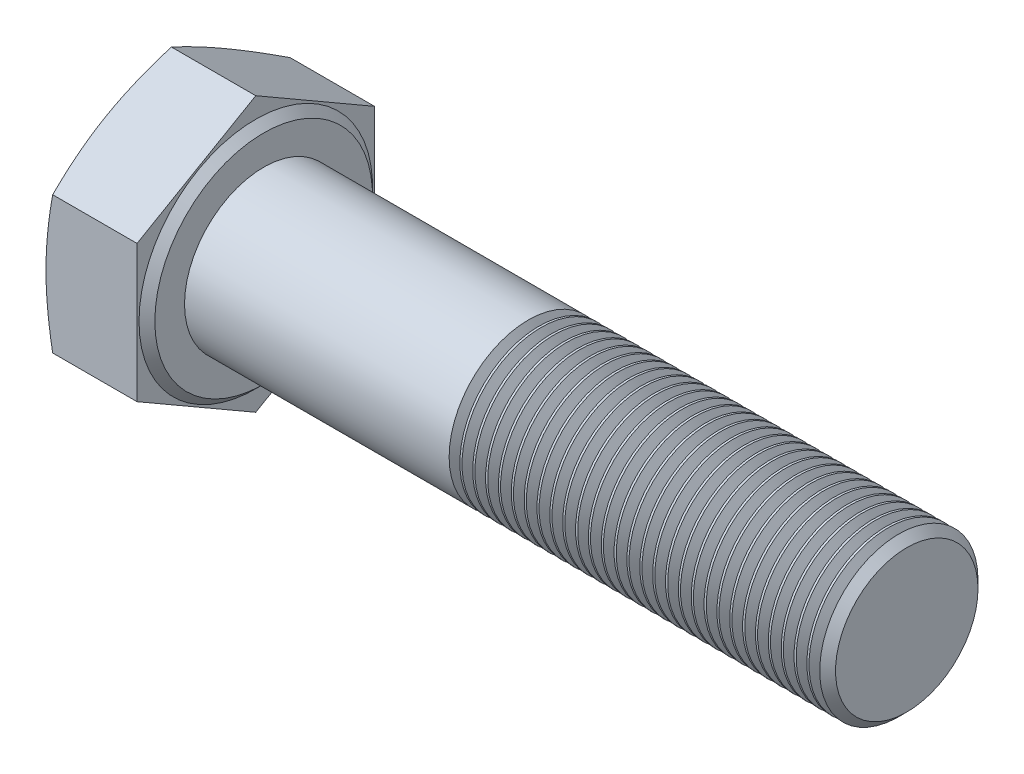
ISO-10303-21;
HEADER;
FILE_DESCRIPTION(('STEP AP214'),'2;1');
FILE_NAME('part.step','',(''),(''),'','','');
FILE_SCHEMA(('AUTOMOTIVE_DESIGN { 1 0 10303 214 1 1 1 1 }'));
ENDSEC;
DATA;
#1=APPLICATION_CONTEXT('core data for automotive mechanical design processes');
#2=APPLICATION_PROTOCOL_DEFINITION('international standard','automotive_design',2000,#1);
#3=PRODUCT_CONTEXT('',#1,'mechanical');
#4=PRODUCT('Part','Part','',(#3));
#5=PRODUCT_RELATED_PRODUCT_CATEGORY('part','',(#4));
#6=PRODUCT_DEFINITION_FORMATION('','',#4);
#7=PRODUCT_DEFINITION_CONTEXT('part definition',#1,'design');
#8=PRODUCT_DEFINITION('design','',#6,#7);
#9=PRODUCT_DEFINITION_SHAPE('','',#8);
#10=(LENGTH_UNIT() NAMED_UNIT(*) SI_UNIT(.MILLI.,.METRE.));
#11=(NAMED_UNIT(*) PLANE_ANGLE_UNIT() SI_UNIT($,.RADIAN.));
#12=(NAMED_UNIT(*) SI_UNIT($,.STERADIAN.) SOLID_ANGLE_UNIT());
#13=UNCERTAINTY_MEASURE_WITH_UNIT(LENGTH_MEASURE(1.E-05),#10,'distance_accuracy_value','');
#14=(GEOMETRIC_REPRESENTATION_CONTEXT(3) GLOBAL_UNCERTAINTY_ASSIGNED_CONTEXT((#13)) GLOBAL_UNIT_ASSIGNED_CONTEXT((#10,
#11,#12)) REPRESENTATION_CONTEXT('',''));
#15=CARTESIAN_POINT('',(0.,0.,0.));
#16=DIRECTION('',(0.,0.,1.));
#17=DIRECTION('',(1.,0.,0.));
#18=AXIS2_PLACEMENT_3D('',#15,#16,#17);
#19=CARTESIAN_POINT('',(75.,0.,0.));
#20=DIRECTION('',(-1.,0.,0.));
#21=DIRECTION('',(0.,0.,1.));
#22=AXIS2_PLACEMENT_3D('',#19,#20,#21);
#23=CYLINDRICAL_SURFACE('',#22,8.);
#24=CARTESIAN_POINT('',(37.828,0.,0.));
#25=DIRECTION('',(1.,0.,0.));
#26=DIRECTION('',(0.,0.,-1.));
#27=AXIS2_PLACEMENT_3D('',#24,#25,#26);
#28=CIRCLE('',#27,8.);
#29=CARTESIAN_POINT('',(37.828,0.,-8.));
#30=VERTEX_POINT('',#29);
#31=EDGE_CURVE('E586',#30,#30,#28,.T.);
#32=ORIENTED_EDGE('',*,*,#31,.T.);
#33=EDGE_LOOP('',(#32));
#34=FACE_BOUND('',#33,.T.);
#35=CARTESIAN_POINT('',(38.0445,0.,0.));
#36=DIRECTION('',(1.,0.,0.));
#37=DIRECTION('',(0.,0.,-1.));
#38=AXIS2_PLACEMENT_3D('',#35,#36,#37);
#39=CIRCLE('',#38,8.);
#40=CARTESIAN_POINT('',(38.0445,0.,-8.));
#41=VERTEX_POINT('',#40);
#42=EDGE_CURVE('E590',#41,#41,#39,.T.);
#43=ORIENTED_EDGE('',*,*,#42,.F.);
#44=EDGE_LOOP('',(#43));
#45=FACE_BOUND('',#44,.T.);
#46=ADVANCED_FACE('F38',(#34,#45),#23,.T.);
#47=CARTESIAN_POINT('',(39.127,0.,0.));
#48=DIRECTION('',(1.,0.,0.));
#49=DIRECTION('',(0.,0.,-1.));
#50=AXIS2_PLACEMENT_3D('',#47,#48,#49);
#51=CIRCLE('',#50,8.);
#52=CARTESIAN_POINT('',(39.127,0.,-8.));
#53=VERTEX_POINT('',#52);
#54=EDGE_CURVE('E596',#53,#53,#51,.T.);
#55=ORIENTED_EDGE('',*,*,#54,.T.);
#56=EDGE_LOOP('',(#55));
#57=FACE_BOUND('',#56,.T.);
#58=CARTESIAN_POINT('',(39.3435,0.,0.));
#59=DIRECTION('',(1.,0.,0.));
#60=DIRECTION('',(0.,0.,-1.));
#61=AXIS2_PLACEMENT_3D('',#58,#59,#60);
#62=CIRCLE('',#61,8.);
#63=CARTESIAN_POINT('',(39.3435,0.,-8.));
#64=VERTEX_POINT('',#63);
#65=EDGE_CURVE('E599',#64,#64,#62,.T.);
#66=ORIENTED_EDGE('',*,*,#65,.F.);
#67=EDGE_LOOP('',(#66));
#68=FACE_BOUND('',#67,.T.);
#69=ADVANCED_FACE('F271',(#57,#68),#23,.T.);
#70=CARTESIAN_POINT('',(40.426,0.,0.));
#71=DIRECTION('',(1.,0.,0.));
#72=DIRECTION('',(0.,0.,-1.));
#73=AXIS2_PLACEMENT_3D('',#70,#71,#72);
#74=CIRCLE('',#73,8.);
#75=CARTESIAN_POINT('',(40.426,0.,-8.));
#76=VERTEX_POINT('',#75);
#77=EDGE_CURVE('E605',#76,#76,#74,.T.);
#78=ORIENTED_EDGE('',*,*,#77,.T.);
#79=EDGE_LOOP('',(#78));
#80=FACE_BOUND('',#79,.T.);
#81=CARTESIAN_POINT('',(40.6425,0.,0.));
#82=DIRECTION('',(1.,0.,0.));
#83=DIRECTION('',(0.,0.,-1.));
#84=AXIS2_PLACEMENT_3D('',#81,#82,#83);
#85=CIRCLE('',#84,8.);
#86=CARTESIAN_POINT('',(40.6425,0.,-8.));
#87=VERTEX_POINT('',#86);
#88=EDGE_CURVE('E608',#87,#87,#85,.T.);
#89=ORIENTED_EDGE('',*,*,#88,.F.);
#90=EDGE_LOOP('',(#89));
#91=FACE_BOUND('',#90,.T.);
#92=ADVANCED_FACE('F276',(#80,#91),#23,.T.);
#93=CARTESIAN_POINT('',(41.725,0.,0.));
#94=DIRECTION('',(1.,0.,0.));
#95=DIRECTION('',(0.,0.,-1.));
#96=AXIS2_PLACEMENT_3D('',#93,#94,#95);
#97=CIRCLE('',#96,8.);
#98=CARTESIAN_POINT('',(41.725,0.,-8.));
#99=VERTEX_POINT('',#98);
#100=EDGE_CURVE('E614',#99,#99,#97,.T.);
#101=ORIENTED_EDGE('',*,*,#100,.T.);
#102=EDGE_LOOP('',(#101));
#103=FACE_BOUND('',#102,.T.);
#104=CARTESIAN_POINT('',(41.9415,0.,0.));
#105=DIRECTION('',(1.,0.,0.));
#106=DIRECTION('',(0.,0.,-1.));
#107=AXIS2_PLACEMENT_3D('',#104,#105,#106);
#108=CIRCLE('',#107,8.);
#109=CARTESIAN_POINT('',(41.9415,0.,-8.));
#110=VERTEX_POINT('',#109);
#111=EDGE_CURVE('E617',#110,#110,#108,.T.);
#112=ORIENTED_EDGE('',*,*,#111,.F.);
#113=EDGE_LOOP('',(#112));
#114=FACE_BOUND('',#113,.T.);
#115=ADVANCED_FACE('F1044',(#103,#114),#23,.T.);
#116=CARTESIAN_POINT('',(43.024,0.,0.));
#117=DIRECTION('',(1.,0.,0.));
#118=DIRECTION('',(0.,0.,-1.));
#119=AXIS2_PLACEMENT_3D('',#116,#117,#118);
#120=CIRCLE('',#119,8.);
#121=CARTESIAN_POINT('',(43.024,0.,-8.));
#122=VERTEX_POINT('',#121);
#123=EDGE_CURVE('E623',#122,#122,#120,.T.);
#124=ORIENTED_EDGE('',*,*,#123,.T.);
#125=EDGE_LOOP('',(#124));
#126=FACE_BOUND('',#125,.T.);
#127=CARTESIAN_POINT('',(43.2405,0.,0.));
#128=DIRECTION('',(1.,0.,0.));
#129=DIRECTION('',(0.,0.,-1.));
#130=AXIS2_PLACEMENT_3D('',#127,#128,#129);
#131=CIRCLE('',#130,8.);
#132=CARTESIAN_POINT('',(43.2405,0.,-8.));
#133=VERTEX_POINT('',#132);
#134=EDGE_CURVE('E626',#133,#133,#131,.T.);
#135=ORIENTED_EDGE('',*,*,#134,.F.);
#136=EDGE_LOOP('',(#135));
#137=FACE_BOUND('',#136,.T.);
#138=ADVANCED_FACE('F1033',(#126,#137),#23,.T.);
#139=CARTESIAN_POINT('',(44.323,0.,0.));
#140=DIRECTION('',(1.,0.,0.));
#141=DIRECTION('',(0.,0.,-1.));
#142=AXIS2_PLACEMENT_3D('',#139,#140,#141);
#143=CIRCLE('',#142,8.);
#144=CARTESIAN_POINT('',(44.323,0.,-8.));
#145=VERTEX_POINT('',#144);
#146=EDGE_CURVE('E632',#145,#145,#143,.T.);
#147=ORIENTED_EDGE('',*,*,#146,.T.);
#148=EDGE_LOOP('',(#147));
#149=FACE_BOUND('',#148,.T.);
#150=CARTESIAN_POINT('',(44.5395,0.,0.));
#151=DIRECTION('',(1.,0.,0.));
#152=DIRECTION('',(0.,0.,-1.));
#153=AXIS2_PLACEMENT_3D('',#150,#151,#152);
#154=CIRCLE('',#153,8.);
#155=CARTESIAN_POINT('',(44.5395,0.,-8.));
#156=VERTEX_POINT('',#155);
#157=EDGE_CURVE('E635',#156,#156,#154,.T.);
#158=ORIENTED_EDGE('',*,*,#157,.F.);
#159=EDGE_LOOP('',(#158));
#160=FACE_BOUND('',#159,.T.);
#161=ADVANCED_FACE('F1022',(#149,#160),#23,.T.);
#162=CARTESIAN_POINT('',(45.622,0.,0.));
#163=DIRECTION('',(1.,0.,0.));
#164=DIRECTION('',(0.,0.,-1.));
#165=AXIS2_PLACEMENT_3D('',#162,#163,#164);
#166=CIRCLE('',#165,8.);
#167=CARTESIAN_POINT('',(45.622,0.,-8.));
#168=VERTEX_POINT('',#167);
#169=EDGE_CURVE('E641',#168,#168,#166,.T.);
#170=ORIENTED_EDGE('',*,*,#169,.T.);
#171=EDGE_LOOP('',(#170));
#172=FACE_BOUND('',#171,.T.);
#173=CARTESIAN_POINT('',(45.8385,0.,0.));
#174=DIRECTION('',(1.,0.,0.));
#175=DIRECTION('',(0.,0.,-1.));
#176=AXIS2_PLACEMENT_3D('',#173,#174,#175);
#177=CIRCLE('',#176,8.);
#178=CARTESIAN_POINT('',(45.8385,0.,-8.));
#179=VERTEX_POINT('',#178);
#180=EDGE_CURVE('E644',#179,#179,#177,.T.);
#181=ORIENTED_EDGE('',*,*,#180,.F.);
#182=EDGE_LOOP('',(#181));
#183=FACE_BOUND('',#182,.T.);
#184=ADVANCED_FACE('F1011',(#172,#183),#23,.T.);
#185=CARTESIAN_POINT('',(46.921,0.,0.));
#186=DIRECTION('',(1.,0.,0.));
#187=DIRECTION('',(0.,0.,-1.));
#188=AXIS2_PLACEMENT_3D('',#185,#186,#187);
#189=CIRCLE('',#188,8.);
#190=CARTESIAN_POINT('',(46.921,0.,-8.));
#191=VERTEX_POINT('',#190);
#192=EDGE_CURVE('E650',#191,#191,#189,.T.);
#193=ORIENTED_EDGE('',*,*,#192,.T.);
#194=EDGE_LOOP('',(#193));
#195=FACE_BOUND('',#194,.T.);
#196=CARTESIAN_POINT('',(47.1375,0.,0.));
#197=DIRECTION('',(1.,0.,0.));
#198=DIRECTION('',(0.,0.,-1.));
#199=AXIS2_PLACEMENT_3D('',#196,#197,#198);
#200=CIRCLE('',#199,8.);
#201=CARTESIAN_POINT('',(47.1375,0.,-8.));
#202=VERTEX_POINT('',#201);
#203=EDGE_CURVE('E653',#202,#202,#200,.T.);
#204=ORIENTED_EDGE('',*,*,#203,.F.);
#205=EDGE_LOOP('',(#204));
#206=FACE_BOUND('',#205,.T.);
#207=ADVANCED_FACE('F1000',(#195,#206),#23,.T.);
#208=CARTESIAN_POINT('',(48.22,0.,0.));
#209=DIRECTION('',(1.,0.,0.));
#210=DIRECTION('',(0.,0.,-1.));
#211=AXIS2_PLACEMENT_3D('',#208,#209,#210);
#212=CIRCLE('',#211,8.);
#213=CARTESIAN_POINT('',(48.22,0.,-8.));
#214=VERTEX_POINT('',#213);
#215=EDGE_CURVE('E659',#214,#214,#212,.T.);
#216=ORIENTED_EDGE('',*,*,#215,.T.);
#217=EDGE_LOOP('',(#216));
#218=FACE_BOUND('',#217,.T.);
#219=CARTESIAN_POINT('',(48.4365,0.,0.));
#220=DIRECTION('',(1.,0.,0.));
#221=DIRECTION('',(0.,0.,-1.));
#222=AXIS2_PLACEMENT_3D('',#219,#220,#221);
#223=CIRCLE('',#222,8.);
#224=CARTESIAN_POINT('',(48.4365,0.,-8.));
#225=VERTEX_POINT('',#224);
#226=EDGE_CURVE('E662',#225,#225,#223,.T.);
#227=ORIENTED_EDGE('',*,*,#226,.F.);
#228=EDGE_LOOP('',(#227));
#229=FACE_BOUND('',#228,.T.);
#230=ADVANCED_FACE('F989',(#218,#229),#23,.T.);
#231=CARTESIAN_POINT('',(49.519,0.,0.));
#232=DIRECTION('',(1.,0.,0.));
#233=DIRECTION('',(0.,0.,-1.));
#234=AXIS2_PLACEMENT_3D('',#231,#232,#233);
#235=CIRCLE('',#234,8.);
#236=CARTESIAN_POINT('',(49.519,0.,-8.));
#237=VERTEX_POINT('',#236);
#238=EDGE_CURVE('E668',#237,#237,#235,.T.);
#239=ORIENTED_EDGE('',*,*,#238,.T.);
#240=EDGE_LOOP('',(#239));
#241=FACE_BOUND('',#240,.T.);
#242=CARTESIAN_POINT('',(49.7355,0.,0.));
#243=DIRECTION('',(1.,0.,0.));
#244=DIRECTION('',(0.,0.,-1.));
#245=AXIS2_PLACEMENT_3D('',#242,#243,#244);
#246=CIRCLE('',#245,8.);
#247=CARTESIAN_POINT('',(49.7355,0.,-8.));
#248=VERTEX_POINT('',#247);
#249=EDGE_CURVE('E671',#248,#248,#246,.T.);
#250=ORIENTED_EDGE('',*,*,#249,.F.);
#251=EDGE_LOOP('',(#250));
#252=FACE_BOUND('',#251,.T.);
#253=ADVANCED_FACE('F978',(#241,#252),#23,.T.);
#254=CARTESIAN_POINT('',(50.818,0.,0.));
#255=DIRECTION('',(1.,0.,0.));
#256=DIRECTION('',(0.,0.,-1.));
#257=AXIS2_PLACEMENT_3D('',#254,#255,#256);
#258=CIRCLE('',#257,8.);
#259=CARTESIAN_POINT('',(50.818,0.,-8.));
#260=VERTEX_POINT('',#259);
#261=EDGE_CURVE('E677',#260,#260,#258,.T.);
#262=ORIENTED_EDGE('',*,*,#261,.T.);
#263=EDGE_LOOP('',(#262));
#264=FACE_BOUND('',#263,.T.);
#265=CARTESIAN_POINT('',(51.0345,0.,0.));
#266=DIRECTION('',(1.,0.,0.));
#267=DIRECTION('',(0.,0.,-1.));
#268=AXIS2_PLACEMENT_3D('',#265,#266,#267);
#269=CIRCLE('',#268,8.);
#270=CARTESIAN_POINT('',(51.0345,0.,-8.));
#271=VERTEX_POINT('',#270);
#272=EDGE_CURVE('E680',#271,#271,#269,.T.);
#273=ORIENTED_EDGE('',*,*,#272,.F.);
#274=EDGE_LOOP('',(#273));
#275=FACE_BOUND('',#274,.T.);
#276=ADVANCED_FACE('F967',(#264,#275),#23,.T.);
#277=CARTESIAN_POINT('',(52.117,0.,0.));
#278=DIRECTION('',(1.,0.,0.));
#279=DIRECTION('',(0.,0.,-1.));
#280=AXIS2_PLACEMENT_3D('',#277,#278,#279);
#281=CIRCLE('',#280,8.);
#282=CARTESIAN_POINT('',(52.117,0.,-8.));
#283=VERTEX_POINT('',#282);
#284=EDGE_CURVE('E686',#283,#283,#281,.T.);
#285=ORIENTED_EDGE('',*,*,#284,.T.);
#286=EDGE_LOOP('',(#285));
#287=FACE_BOUND('',#286,.T.);
#288=CARTESIAN_POINT('',(52.3335,0.,0.));
#289=DIRECTION('',(1.,0.,0.));
#290=DIRECTION('',(0.,0.,-1.));
#291=AXIS2_PLACEMENT_3D('',#288,#289,#290);
#292=CIRCLE('',#291,8.);
#293=CARTESIAN_POINT('',(52.3335,0.,-8.));
#294=VERTEX_POINT('',#293);
#295=EDGE_CURVE('E689',#294,#294,#292,.T.);
#296=ORIENTED_EDGE('',*,*,#295,.F.);
#297=EDGE_LOOP('',(#296));
#298=FACE_BOUND('',#297,.T.);
#299=ADVANCED_FACE('F956',(#287,#298),#23,.T.);
#300=CARTESIAN_POINT('',(53.416,0.,0.));
#301=DIRECTION('',(1.,0.,0.));
#302=DIRECTION('',(0.,0.,-1.));
#303=AXIS2_PLACEMENT_3D('',#300,#301,#302);
#304=CIRCLE('',#303,8.);
#305=CARTESIAN_POINT('',(53.416,0.,-8.));
#306=VERTEX_POINT('',#305);
#307=EDGE_CURVE('E695',#306,#306,#304,.T.);
#308=ORIENTED_EDGE('',*,*,#307,.T.);
#309=EDGE_LOOP('',(#308));
#310=FACE_BOUND('',#309,.T.);
#311=CARTESIAN_POINT('',(53.6325,0.,0.));
#312=DIRECTION('',(1.,0.,0.));
#313=DIRECTION('',(0.,0.,-1.));
#314=AXIS2_PLACEMENT_3D('',#311,#312,#313);
#315=CIRCLE('',#314,8.);
#316=CARTESIAN_POINT('',(53.6325,0.,-8.));
#317=VERTEX_POINT('',#316);
#318=EDGE_CURVE('E698',#317,#317,#315,.T.);
#319=ORIENTED_EDGE('',*,*,#318,.F.);
#320=EDGE_LOOP('',(#319));
#321=FACE_BOUND('',#320,.T.);
#322=ADVANCED_FACE('F945',(#310,#321),#23,.T.);
#323=CARTESIAN_POINT('',(54.715,0.,0.));
#324=DIRECTION('',(1.,0.,0.));
#325=DIRECTION('',(0.,0.,-1.));
#326=AXIS2_PLACEMENT_3D('',#323,#324,#325);
#327=CIRCLE('',#326,8.);
#328=CARTESIAN_POINT('',(54.715,0.,-8.));
#329=VERTEX_POINT('',#328);
#330=EDGE_CURVE('E704',#329,#329,#327,.T.);
#331=ORIENTED_EDGE('',*,*,#330,.T.);
#332=EDGE_LOOP('',(#331));
#333=FACE_BOUND('',#332,.T.);
#334=CARTESIAN_POINT('',(54.9315,0.,0.));
#335=DIRECTION('',(1.,0.,0.));
#336=DIRECTION('',(0.,0.,-1.));
#337=AXIS2_PLACEMENT_3D('',#334,#335,#336);
#338=CIRCLE('',#337,8.);
#339=CARTESIAN_POINT('',(54.9315,0.,-8.));
#340=VERTEX_POINT('',#339);
#341=EDGE_CURVE('E707',#340,#340,#338,.T.);
#342=ORIENTED_EDGE('',*,*,#341,.F.);
#343=EDGE_LOOP('',(#342));
#344=FACE_BOUND('',#343,.T.);
#345=ADVANCED_FACE('F934',(#333,#344),#23,.T.);
#346=CARTESIAN_POINT('',(56.014,0.,0.));
#347=DIRECTION('',(1.,0.,0.));
#348=DIRECTION('',(0.,0.,-1.));
#349=AXIS2_PLACEMENT_3D('',#346,#347,#348);
#350=CIRCLE('',#349,8.);
#351=CARTESIAN_POINT('',(56.014,0.,-8.));
#352=VERTEX_POINT('',#351);
#353=EDGE_CURVE('E713',#352,#352,#350,.T.);
#354=ORIENTED_EDGE('',*,*,#353,.T.);
#355=EDGE_LOOP('',(#354));
#356=FACE_BOUND('',#355,.T.);
#357=CARTESIAN_POINT('',(56.2305,0.,0.));
#358=DIRECTION('',(1.,0.,0.));
#359=DIRECTION('',(0.,0.,-1.));
#360=AXIS2_PLACEMENT_3D('',#357,#358,#359);
#361=CIRCLE('',#360,8.);
#362=CARTESIAN_POINT('',(56.2305,0.,-8.));
#363=VERTEX_POINT('',#362);
#364=EDGE_CURVE('E716',#363,#363,#361,.T.);
#365=ORIENTED_EDGE('',*,*,#364,.F.);
#366=EDGE_LOOP('',(#365));
#367=FACE_BOUND('',#366,.T.);
#368=ADVANCED_FACE('F923',(#356,#367),#23,.T.);
#369=CARTESIAN_POINT('',(57.313,0.,0.));
#370=DIRECTION('',(1.,0.,0.));
#371=DIRECTION('',(0.,0.,-1.));
#372=AXIS2_PLACEMENT_3D('',#369,#370,#371);
#373=CIRCLE('',#372,8.);
#374=CARTESIAN_POINT('',(57.313,0.,-8.));
#375=VERTEX_POINT('',#374);
#376=EDGE_CURVE('E722',#375,#375,#373,.T.);
#377=ORIENTED_EDGE('',*,*,#376,.T.);
#378=EDGE_LOOP('',(#377));
#379=FACE_BOUND('',#378,.T.);
#380=CARTESIAN_POINT('',(57.5295,0.,0.));
#381=DIRECTION('',(1.,0.,0.));
#382=DIRECTION('',(0.,0.,-1.));
#383=AXIS2_PLACEMENT_3D('',#380,#381,#382);
#384=CIRCLE('',#383,8.);
#385=CARTESIAN_POINT('',(57.5295,0.,-8.));
#386=VERTEX_POINT('',#385);
#387=EDGE_CURVE('E725',#386,#386,#384,.T.);
#388=ORIENTED_EDGE('',*,*,#387,.F.);
#389=EDGE_LOOP('',(#388));
#390=FACE_BOUND('',#389,.T.);
#391=ADVANCED_FACE('F912',(#379,#390),#23,.T.);
#392=CARTESIAN_POINT('',(58.612,0.,0.));
#393=DIRECTION('',(1.,0.,0.));
#394=DIRECTION('',(0.,0.,-1.));
#395=AXIS2_PLACEMENT_3D('',#392,#393,#394);
#396=CIRCLE('',#395,8.);
#397=CARTESIAN_POINT('',(58.612,0.,-8.));
#398=VERTEX_POINT('',#397);
#399=EDGE_CURVE('E731',#398,#398,#396,.T.);
#400=ORIENTED_EDGE('',*,*,#399,.T.);
#401=EDGE_LOOP('',(#400));
#402=FACE_BOUND('',#401,.T.);
#403=CARTESIAN_POINT('',(58.8285,0.,0.));
#404=DIRECTION('',(1.,0.,0.));
#405=DIRECTION('',(0.,0.,-1.));
#406=AXIS2_PLACEMENT_3D('',#403,#404,#405);
#407=CIRCLE('',#406,8.);
#408=CARTESIAN_POINT('',(58.8285,0.,-8.));
#409=VERTEX_POINT('',#408);
#410=EDGE_CURVE('E734',#409,#409,#407,.T.);
#411=ORIENTED_EDGE('',*,*,#410,.F.);
#412=EDGE_LOOP('',(#411));
#413=FACE_BOUND('',#412,.T.);
#414=ADVANCED_FACE('F901',(#402,#413),#23,.T.);
#415=CARTESIAN_POINT('',(59.911,0.,0.));
#416=DIRECTION('',(1.,0.,0.));
#417=DIRECTION('',(0.,0.,-1.));
#418=AXIS2_PLACEMENT_3D('',#415,#416,#417);
#419=CIRCLE('',#418,8.);
#420=CARTESIAN_POINT('',(59.911,0.,-8.));
#421=VERTEX_POINT('',#420);
#422=EDGE_CURVE('E740',#421,#421,#419,.T.);
#423=ORIENTED_EDGE('',*,*,#422,.T.);
#424=EDGE_LOOP('',(#423));
#425=FACE_BOUND('',#424,.T.);
#426=CARTESIAN_POINT('',(60.1275,0.,0.));
#427=DIRECTION('',(1.,0.,0.));
#428=DIRECTION('',(0.,0.,-1.));
#429=AXIS2_PLACEMENT_3D('',#426,#427,#428);
#430=CIRCLE('',#429,8.);
#431=CARTESIAN_POINT('',(60.1275,0.,-8.));
#432=VERTEX_POINT('',#431);
#433=EDGE_CURVE('E743',#432,#432,#430,.T.);
#434=ORIENTED_EDGE('',*,*,#433,.F.);
#435=EDGE_LOOP('',(#434));
#436=FACE_BOUND('',#435,.T.);
#437=ADVANCED_FACE('F890',(#425,#436),#23,.T.);
#438=CARTESIAN_POINT('',(61.21,0.,0.));
#439=DIRECTION('',(1.,0.,0.));
#440=DIRECTION('',(0.,0.,-1.));
#441=AXIS2_PLACEMENT_3D('',#438,#439,#440);
#442=CIRCLE('',#441,8.);
#443=CARTESIAN_POINT('',(61.21,0.,-8.));
#444=VERTEX_POINT('',#443);
#445=EDGE_CURVE('E749',#444,#444,#442,.T.);
#446=ORIENTED_EDGE('',*,*,#445,.T.);
#447=EDGE_LOOP('',(#446));
#448=FACE_BOUND('',#447,.T.);
#449=CARTESIAN_POINT('',(61.4265,0.,0.));
#450=DIRECTION('',(1.,0.,0.));
#451=DIRECTION('',(0.,0.,-1.));
#452=AXIS2_PLACEMENT_3D('',#449,#450,#451);
#453=CIRCLE('',#452,8.);
#454=CARTESIAN_POINT('',(61.4265,0.,-8.));
#455=VERTEX_POINT('',#454);
#456=EDGE_CURVE('E752',#455,#455,#453,.T.);
#457=ORIENTED_EDGE('',*,*,#456,.F.);
#458=EDGE_LOOP('',(#457));
#459=FACE_BOUND('',#458,.T.);
#460=ADVANCED_FACE('F879',(#448,#459),#23,.T.);
#461=CARTESIAN_POINT('',(62.509,0.,0.));
#462=DIRECTION('',(1.,0.,0.));
#463=DIRECTION('',(0.,0.,-1.));
#464=AXIS2_PLACEMENT_3D('',#461,#462,#463);
#465=CIRCLE('',#464,8.);
#466=CARTESIAN_POINT('',(62.509,0.,-8.));
#467=VERTEX_POINT('',#466);
#468=EDGE_CURVE('E758',#467,#467,#465,.T.);
#469=ORIENTED_EDGE('',*,*,#468,.T.);
#470=EDGE_LOOP('',(#469));
#471=FACE_BOUND('',#470,.T.);
#472=CARTESIAN_POINT('',(62.7255,0.,0.));
#473=DIRECTION('',(1.,0.,0.));
#474=DIRECTION('',(0.,0.,-1.));
#475=AXIS2_PLACEMENT_3D('',#472,#473,#474);
#476=CIRCLE('',#475,8.);
#477=CARTESIAN_POINT('',(62.7255,0.,-8.));
#478=VERTEX_POINT('',#477);
#479=EDGE_CURVE('E761',#478,#478,#476,.T.);
#480=ORIENTED_EDGE('',*,*,#479,.F.);
#481=EDGE_LOOP('',(#480));
#482=FACE_BOUND('',#481,.T.);
#483=ADVANCED_FACE('F868',(#471,#482),#23,.T.);
#484=CARTESIAN_POINT('',(63.808,0.,0.));
#485=DIRECTION('',(1.,0.,0.));
#486=DIRECTION('',(0.,0.,-1.));
#487=AXIS2_PLACEMENT_3D('',#484,#485,#486);
#488=CIRCLE('',#487,8.);
#489=CARTESIAN_POINT('',(63.808,0.,-8.));
#490=VERTEX_POINT('',#489);
#491=EDGE_CURVE('E767',#490,#490,#488,.T.);
#492=ORIENTED_EDGE('',*,*,#491,.T.);
#493=EDGE_LOOP('',(#492));
#494=FACE_BOUND('',#493,.T.);
#495=CARTESIAN_POINT('',(64.0245,0.,0.));
#496=DIRECTION('',(1.,0.,0.));
#497=DIRECTION('',(0.,0.,-1.));
#498=AXIS2_PLACEMENT_3D('',#495,#496,#497);
#499=CIRCLE('',#498,8.);
#500=CARTESIAN_POINT('',(64.0245,0.,-8.));
#501=VERTEX_POINT('',#500);
#502=EDGE_CURVE('E770',#501,#501,#499,.T.);
#503=ORIENTED_EDGE('',*,*,#502,.F.);
#504=EDGE_LOOP('',(#503));
#505=FACE_BOUND('',#504,.T.);
#506=ADVANCED_FACE('F857',(#494,#505),#23,.T.);
#507=CARTESIAN_POINT('',(65.107,0.,0.));
#508=DIRECTION('',(1.,0.,0.));
#509=DIRECTION('',(0.,0.,-1.));
#510=AXIS2_PLACEMENT_3D('',#507,#508,#509);
#511=CIRCLE('',#510,8.);
#512=CARTESIAN_POINT('',(65.107,0.,-8.));
#513=VERTEX_POINT('',#512);
#514=EDGE_CURVE('E776',#513,#513,#511,.T.);
#515=ORIENTED_EDGE('',*,*,#514,.T.);
#516=EDGE_LOOP('',(#515));
#517=FACE_BOUND('',#516,.T.);
#518=CARTESIAN_POINT('',(65.3235,0.,0.));
#519=DIRECTION('',(1.,0.,0.));
#520=DIRECTION('',(0.,0.,-1.));
#521=AXIS2_PLACEMENT_3D('',#518,#519,#520);
#522=CIRCLE('',#521,8.);
#523=CARTESIAN_POINT('',(65.3235,0.,-8.));
#524=VERTEX_POINT('',#523);
#525=EDGE_CURVE('E779',#524,#524,#522,.T.);
#526=ORIENTED_EDGE('',*,*,#525,.F.);
#527=EDGE_LOOP('',(#526));
#528=FACE_BOUND('',#527,.T.);
#529=ADVANCED_FACE('F846',(#517,#528),#23,.T.);
#530=CARTESIAN_POINT('',(66.406,0.,0.));
#531=DIRECTION('',(1.,0.,0.));
#532=DIRECTION('',(0.,0.,-1.));
#533=AXIS2_PLACEMENT_3D('',#530,#531,#532);
#534=CIRCLE('',#533,8.);
#535=CARTESIAN_POINT('',(66.406,0.,-8.));
#536=VERTEX_POINT('',#535);
#537=EDGE_CURVE('E785',#536,#536,#534,.T.);
#538=ORIENTED_EDGE('',*,*,#537,.T.);
#539=EDGE_LOOP('',(#538));
#540=FACE_BOUND('',#539,.T.);
#541=CARTESIAN_POINT('',(66.6225,0.,0.));
#542=DIRECTION('',(1.,0.,0.));
#543=DIRECTION('',(0.,0.,-1.));
#544=AXIS2_PLACEMENT_3D('',#541,#542,#543);
#545=CIRCLE('',#544,8.);
#546=CARTESIAN_POINT('',(66.6225,0.,-8.));
#547=VERTEX_POINT('',#546);
#548=EDGE_CURVE('E788',#547,#547,#545,.T.);
#549=ORIENTED_EDGE('',*,*,#548,.F.);
#550=EDGE_LOOP('',(#549));
#551=FACE_BOUND('',#550,.T.);
#552=ADVANCED_FACE('F835',(#540,#551),#23,.T.);
#553=CARTESIAN_POINT('',(67.705,0.,0.));
#554=DIRECTION('',(1.,0.,0.));
#555=DIRECTION('',(0.,0.,-1.));
#556=AXIS2_PLACEMENT_3D('',#553,#554,#555);
#557=CIRCLE('',#556,8.);
#558=CARTESIAN_POINT('',(67.705,0.,-8.));
#559=VERTEX_POINT('',#558);
#560=EDGE_CURVE('E794',#559,#559,#557,.T.);
#561=ORIENTED_EDGE('',*,*,#560,.T.);
#562=EDGE_LOOP('',(#561));
#563=FACE_BOUND('',#562,.T.);
#564=CARTESIAN_POINT('',(67.9215,0.,0.));
#565=DIRECTION('',(1.,0.,0.));
#566=DIRECTION('',(0.,0.,-1.));
#567=AXIS2_PLACEMENT_3D('',#564,#565,#566);
#568=CIRCLE('',#567,8.);
#569=CARTESIAN_POINT('',(67.9215,0.,-8.));
#570=VERTEX_POINT('',#569);
#571=EDGE_CURVE('E797',#570,#570,#568,.T.);
#572=ORIENTED_EDGE('',*,*,#571,.F.);
#573=EDGE_LOOP('',(#572));
#574=FACE_BOUND('',#573,.T.);
#575=ADVANCED_FACE('F830',(#563,#574),#23,.T.);
#576=CARTESIAN_POINT('',(69.004,0.,0.));
#577=DIRECTION('',(1.,0.,0.));
#578=DIRECTION('',(0.,0.,-1.));
#579=AXIS2_PLACEMENT_3D('',#576,#577,#578);
#580=CIRCLE('',#579,8.);
#581=CARTESIAN_POINT('',(69.004,0.,-8.));
#582=VERTEX_POINT('',#581);
#583=EDGE_CURVE('E803',#582,#582,#580,.T.);
#584=ORIENTED_EDGE('',*,*,#583,.T.);
#585=EDGE_LOOP('',(#584));
#586=FACE_BOUND('',#585,.T.);
#587=CARTESIAN_POINT('',(69.2205,0.,0.));
#588=DIRECTION('',(1.,0.,0.));
#589=DIRECTION('',(0.,0.,-1.));
#590=AXIS2_PLACEMENT_3D('',#587,#588,#589);
#591=CIRCLE('',#590,8.);
#592=CARTESIAN_POINT('',(69.2205,0.,-8.));
#593=VERTEX_POINT('',#592);
#594=EDGE_CURVE('E806',#593,#593,#591,.T.);
#595=ORIENTED_EDGE('',*,*,#594,.F.);
#596=EDGE_LOOP('',(#595));
#597=FACE_BOUND('',#596,.T.);
#598=ADVANCED_FACE('F314',(#586,#597),#23,.T.);
#599=CARTESIAN_POINT('',(70.303,0.,0.));
#600=DIRECTION('',(1.,0.,0.));
#601=DIRECTION('',(0.,0.,-1.));
#602=AXIS2_PLACEMENT_3D('',#599,#600,#601);
#603=CIRCLE('',#602,8.);
#604=CARTESIAN_POINT('',(70.303,0.,-8.));
#605=VERTEX_POINT('',#604);
#606=EDGE_CURVE('E812',#605,#605,#603,.T.);
#607=ORIENTED_EDGE('',*,*,#606,.T.);
#608=EDGE_LOOP('',(#607));
#609=FACE_BOUND('',#608,.T.);
#610=CARTESIAN_POINT('',(70.5195,0.,0.));
#611=DIRECTION('',(1.,0.,0.));
#612=DIRECTION('',(0.,0.,-1.));
#613=AXIS2_PLACEMENT_3D('',#610,#611,#612);
#614=CIRCLE('',#613,8.);
#615=CARTESIAN_POINT('',(70.5195,0.,-8.));
#616=VERTEX_POINT('',#615);
#617=EDGE_CURVE('E815',#616,#616,#614,.T.);
#618=ORIENTED_EDGE('',*,*,#617,.F.);
#619=EDGE_LOOP('',(#618));
#620=FACE_BOUND('',#619,.T.);
#621=ADVANCED_FACE('F305',(#609,#620),#23,.T.);
#622=CARTESIAN_POINT('',(71.602,0.,0.));
#623=DIRECTION('',(1.,0.,0.));
#624=DIRECTION('',(0.,0.,-1.));
#625=AXIS2_PLACEMENT_3D('',#622,#623,#624);
#626=CIRCLE('',#625,8.);
#627=CARTESIAN_POINT('',(71.602,0.,-8.));
#628=VERTEX_POINT('',#627);
#629=EDGE_CURVE('E319',#628,#628,#626,.T.);
#630=ORIENTED_EDGE('',*,*,#629,.T.);
#631=EDGE_LOOP('',(#630));
#632=FACE_BOUND('',#631,.T.);
#633=CARTESIAN_POINT('',(71.8185,0.,0.));
#634=DIRECTION('',(1.,0.,0.));
#635=DIRECTION('',(0.,0.,-1.));
#636=AXIS2_PLACEMENT_3D('',#633,#634,#635);
#637=CIRCLE('',#636,8.);
#638=CARTESIAN_POINT('',(71.8185,0.,-8.));
#639=VERTEX_POINT('',#638);
#640=EDGE_CURVE('E322',#639,#639,#637,.T.);
#641=ORIENTED_EDGE('',*,*,#640,.F.);
#642=EDGE_LOOP('',(#641));
#643=FACE_BOUND('',#642,.T.);
#644=ADVANCED_FACE('F290',(#632,#643),#23,.T.);
#645=CARTESIAN_POINT('',(72.35975,0.,0.));
#646=DIRECTION('',(1.,0.,0.));
#647=DIRECTION('',(0.,0.,-1.));
#648=AXIS2_PLACEMENT_3D('',#645,#646,#647);
#649=CONICAL_SURFACE('',#648,7.06252750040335,1.0471975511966);
#650=CARTESIAN_POINT('',(72.901,0.,0.));
#651=DIRECTION('',(1.,0.,0.));
#652=DIRECTION('',(0.,0.,-1.));
#653=AXIS2_PLACEMENT_3D('',#650,#651,#652);
#654=CIRCLE('',#653,8.);
#655=CARTESIAN_POINT('',(72.901,0.,-8.));
#656=VERTEX_POINT('',#655);
#657=EDGE_CURVE('E327',#656,#656,#654,.T.);
#658=ORIENTED_EDGE('',*,*,#657,.F.);
#659=EDGE_LOOP('',(#658));
#660=FACE_BOUND('',#659,.T.);
#661=CARTESIAN_POINT('',(72.35975,0.,0.));
#662=DIRECTION('',(1.,0.,0.));
#663=DIRECTION('',(0.,0.,-1.));
#664=AXIS2_PLACEMENT_3D('',#661,#662,#663);
#665=CIRCLE('',#664,7.06252750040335);
#666=CARTESIAN_POINT('',(72.35975,0.,-7.06252750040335));
#667=VERTEX_POINT('',#666);
#668=EDGE_CURVE('E324',#667,#667,#665,.T.);
#669=ORIENTED_EDGE('',*,*,#668,.T.);
#670=EDGE_LOOP('',(#669));
#671=FACE_BOUND('',#670,.T.);
#672=ADVANCED_FACE('F304',(#660,#671),#649,.T.);
#673=CARTESIAN_POINT('',(71.8185,0.,0.));
#674=DIRECTION('',(-1.,0.,0.));
#675=DIRECTION('',(0.,0.,1.));
#676=AXIS2_PLACEMENT_3D('',#673,#674,#675);
#677=CONICAL_SURFACE('',#676,8.,1.04719755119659);
#678=ORIENTED_EDGE('',*,*,#668,.F.);
#679=EDGE_LOOP('',(#678));
#680=FACE_BOUND('',#679,.T.);
#681=ORIENTED_EDGE('',*,*,#640,.T.);
#682=EDGE_LOOP('',(#681));
#683=FACE_BOUND('',#682,.T.);
#684=ADVANCED_FACE('F311',(#680,#683),#677,.T.);
#685=CARTESIAN_POINT('',(75.,0.,0.));
#686=DIRECTION('',(1.,0.,0.));
#687=DIRECTION('',(0.,0.,-1.));
#688=AXIS2_PLACEMENT_3D('',#685,#686,#687);
#689=PLANE('',#688);
#690=CARTESIAN_POINT('',(75.,0.,0.));
#691=DIRECTION('',(1.,0.,0.));
#692=DIRECTION('',(0.,0.,-1.));
#693=AXIS2_PLACEMENT_3D('',#690,#691,#692);
#694=CIRCLE('',#693,7.2);
#695=CARTESIAN_POINT('',(75.,0.,-7.2));
#696=VERTEX_POINT('',#695);
#697=EDGE_CURVE('E11',#696,#696,#694,.T.);
#698=ORIENTED_EDGE('',*,*,#697,.T.);
#699=EDGE_LOOP('',(#698));
#700=FACE_BOUND('',#699,.T.);
#701=ADVANCED_FACE('F355',(#700),#689,.T.);
#702=CARTESIAN_POINT('',(75.,0.,0.));
#703=DIRECTION('',(-1.,0.,0.));
#704=DIRECTION('',(0.,0.,1.));
#705=AXIS2_PLACEMENT_3D('',#702,#703,#704);
#706=CONICAL_SURFACE('',#705,7.2,0.785398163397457);
#707=CARTESIAN_POINT('',(74.2,0.,0.));
#708=DIRECTION('',(1.,0.,0.));
#709=DIRECTION('',(0.,0.,-1.));
#710=AXIS2_PLACEMENT_3D('',#707,#708,#709);
#711=CIRCLE('',#710,8.);
#712=CARTESIAN_POINT('',(74.2,0.,-8.));
#713=VERTEX_POINT('',#712);
#714=EDGE_CURVE('E340',#713,#713,#711,.T.);
#715=ORIENTED_EDGE('',*,*,#714,.T.);
#716=EDGE_LOOP('',(#715));
#717=FACE_BOUND('',#716,.T.);
#718=ORIENTED_EDGE('',*,*,#697,.F.);
#719=EDGE_LOOP('',(#718));
#720=FACE_BOUND('',#719,.T.);
#721=ADVANCED_FACE('F40',(#717,#720),#706,.T.);
#722=CARTESIAN_POINT('',(73.65875,0.,0.));
#723=DIRECTION('',(1.,0.,0.));
#724=DIRECTION('',(0.,0.,-1.));
#725=AXIS2_PLACEMENT_3D('',#722,#723,#724);
#726=CONICAL_SURFACE('',#725,7.06252750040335,1.0471975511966);
#727=ORIENTED_EDGE('',*,*,#714,.F.);
#728=EDGE_LOOP('',(#727));
#729=FACE_BOUND('',#728,.T.);
#730=CARTESIAN_POINT('',(73.65875,0.,0.));
#731=DIRECTION('',(1.,0.,0.));
#732=DIRECTION('',(0.,0.,-1.));
#733=AXIS2_PLACEMENT_3D('',#730,#731,#732);
#734=CIRCLE('',#733,7.06252750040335);
#735=CARTESIAN_POINT('',(73.65875,0.,-7.06252750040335));
#736=VERTEX_POINT('',#735);
#737=EDGE_CURVE('E337',#736,#736,#734,.T.);
#738=ORIENTED_EDGE('',*,*,#737,.T.);
#739=EDGE_LOOP('',(#738));
#740=FACE_BOUND('',#739,.T.);
#741=ADVANCED_FACE('F298',(#729,#740),#726,.T.);
#742=CARTESIAN_POINT('',(73.1175,0.,0.));
#743=DIRECTION('',(-1.,0.,0.));
#744=DIRECTION('',(0.,0.,1.));
#745=AXIS2_PLACEMENT_3D('',#742,#743,#744);
#746=CONICAL_SURFACE('',#745,8.,1.04719755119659);
#747=ORIENTED_EDGE('',*,*,#737,.F.);
#748=EDGE_LOOP('',(#747));
#749=FACE_BOUND('',#748,.T.);
#750=CARTESIAN_POINT('',(73.1175,0.,0.));
#751=DIRECTION('',(1.,0.,0.));
#752=DIRECTION('',(0.,0.,-1.));
#753=AXIS2_PLACEMENT_3D('',#750,#751,#752);
#754=CIRCLE('',#753,8.);
#755=CARTESIAN_POINT('',(73.1175,0.,-8.));
#756=VERTEX_POINT('',#755);
#757=EDGE_CURVE('E334',#756,#756,#754,.T.);
#758=ORIENTED_EDGE('',*,*,#757,.T.);
#759=EDGE_LOOP('',(#758));
#760=FACE_BOUND('',#759,.T.);
#761=ADVANCED_FACE('F288',(#749,#760),#746,.T.);
#762=ORIENTED_EDGE('',*,*,#657,.T.);
#763=EDGE_LOOP('',(#762));
#764=FACE_BOUND('',#763,.T.);
#765=ORIENTED_EDGE('',*,*,#757,.F.);
#766=EDGE_LOOP('',(#765));
#767=FACE_BOUND('',#766,.T.);
#768=ADVANCED_FACE('F282',(#764,#767),#23,.T.);
#769=CARTESIAN_POINT('',(71.06075,0.,0.));
#770=DIRECTION('',(1.,0.,0.));
#771=DIRECTION('',(0.,0.,-1.));
#772=AXIS2_PLACEMENT_3D('',#769,#770,#771);
#773=CONICAL_SURFACE('',#772,7.06252750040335,1.0471975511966);
#774=ORIENTED_EDGE('',*,*,#629,.F.);
#775=EDGE_LOOP('',(#774));
#776=FACE_BOUND('',#775,.T.);
#777=CARTESIAN_POINT('',(71.06075,0.,0.));
#778=DIRECTION('',(1.,0.,0.));
#779=DIRECTION('',(0.,0.,-1.));
#780=AXIS2_PLACEMENT_3D('',#777,#778,#779);
#781=CIRCLE('',#780,7.06252750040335);
#782=CARTESIAN_POINT('',(71.06075,0.,-7.06252750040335));
#783=VERTEX_POINT('',#782);
#784=EDGE_CURVE('E329',#783,#783,#781,.T.);
#785=ORIENTED_EDGE('',*,*,#784,.T.);
#786=EDGE_LOOP('',(#785));
#787=FACE_BOUND('',#786,.T.);
#788=ADVANCED_FACE('F287',(#776,#787),#773,.T.);
#789=CARTESIAN_POINT('',(70.5195,0.,0.));
#790=DIRECTION('',(-1.,0.,0.));
#791=DIRECTION('',(0.,0.,1.));
#792=AXIS2_PLACEMENT_3D('',#789,#790,#791);
#793=CONICAL_SURFACE('',#792,8.,1.04719755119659);
#794=ORIENTED_EDGE('',*,*,#784,.F.);
#795=EDGE_LOOP('',(#794));
#796=FACE_BOUND('',#795,.T.);
#797=ORIENTED_EDGE('',*,*,#617,.T.);
#798=EDGE_LOOP('',(#797));
#799=FACE_BOUND('',#798,.T.);
#800=ADVANCED_FACE('F295',(#796,#799),#793,.T.);
#801=CARTESIAN_POINT('',(69.76175,0.,0.));
#802=DIRECTION('',(1.,0.,0.));
#803=DIRECTION('',(0.,0.,-1.));
#804=AXIS2_PLACEMENT_3D('',#801,#802,#803);
#805=CONICAL_SURFACE('',#804,7.06252750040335,1.0471975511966);
#806=ORIENTED_EDGE('',*,*,#606,.F.);
#807=EDGE_LOOP('',(#806));
#808=FACE_BOUND('',#807,.T.);
#809=CARTESIAN_POINT('',(69.76175,0.,0.));
#810=DIRECTION('',(1.,0.,0.));
#811=DIRECTION('',(0.,0.,-1.));
#812=AXIS2_PLACEMENT_3D('',#809,#810,#811);
#813=CIRCLE('',#812,7.06252750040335);
#814=CARTESIAN_POINT('',(69.76175,0.,-7.06252750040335));
#815=VERTEX_POINT('',#814);
#816=EDGE_CURVE('E809',#815,#815,#813,.T.);
#817=ORIENTED_EDGE('',*,*,#816,.T.);
#818=EDGE_LOOP('',(#817));
#819=FACE_BOUND('',#818,.T.);
#820=ADVANCED_FACE('F370',(#808,#819),#805,.T.);
#821=CARTESIAN_POINT('',(69.2205,0.,0.));
#822=DIRECTION('',(-1.,0.,0.));
#823=DIRECTION('',(0.,0.,1.));
#824=AXIS2_PLACEMENT_3D('',#821,#822,#823);
#825=CONICAL_SURFACE('',#824,8.,1.04719755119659);
#826=ORIENTED_EDGE('',*,*,#816,.F.);
#827=EDGE_LOOP('',(#826));
#828=FACE_BOUND('',#827,.T.);
#829=ORIENTED_EDGE('',*,*,#594,.T.);
#830=EDGE_LOOP('',(#829));
#831=FACE_BOUND('',#830,.T.);
#832=ADVANCED_FACE('F374',(#828,#831),#825,.T.);
#833=CARTESIAN_POINT('',(68.46275,0.,0.));
#834=DIRECTION('',(1.,0.,0.));
#835=DIRECTION('',(0.,0.,-1.));
#836=AXIS2_PLACEMENT_3D('',#833,#834,#835);
#837=CONICAL_SURFACE('',#836,7.06252750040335,1.0471975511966);
#838=ORIENTED_EDGE('',*,*,#583,.F.);
#839=EDGE_LOOP('',(#838));
#840=FACE_BOUND('',#839,.T.);
#841=CARTESIAN_POINT('',(68.46275,0.,0.));
#842=DIRECTION('',(1.,0.,0.));
#843=DIRECTION('',(0.,0.,-1.));
#844=AXIS2_PLACEMENT_3D('',#841,#842,#843);
#845=CIRCLE('',#844,7.06252750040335);
#846=CARTESIAN_POINT('',(68.46275,0.,-7.06252750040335));
#847=VERTEX_POINT('',#846);
#848=EDGE_CURVE('E800',#847,#847,#845,.T.);
#849=ORIENTED_EDGE('',*,*,#848,.T.);
#850=EDGE_LOOP('',(#849));
#851=FACE_BOUND('',#850,.T.);
#852=ADVANCED_FACE('F378',(#840,#851),#837,.T.);
#853=CARTESIAN_POINT('',(67.9215,0.,0.));
#854=DIRECTION('',(-1.,0.,0.));
#855=DIRECTION('',(0.,0.,1.));
#856=AXIS2_PLACEMENT_3D('',#853,#854,#855);
#857=CONICAL_SURFACE('',#856,8.,1.04719755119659);
#858=ORIENTED_EDGE('',*,*,#848,.F.);
#859=EDGE_LOOP('',(#858));
#860=FACE_BOUND('',#859,.T.);
#861=ORIENTED_EDGE('',*,*,#571,.T.);
#862=EDGE_LOOP('',(#861));
#863=FACE_BOUND('',#862,.T.);
#864=ADVANCED_FACE('F382',(#860,#863),#857,.T.);
#865=CARTESIAN_POINT('',(67.16375,0.,0.));
#866=DIRECTION('',(1.,0.,0.));
#867=DIRECTION('',(0.,0.,-1.));
#868=AXIS2_PLACEMENT_3D('',#865,#866,#867);
#869=CONICAL_SURFACE('',#868,7.06252750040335,1.0471975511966);
#870=ORIENTED_EDGE('',*,*,#560,.F.);
#871=EDGE_LOOP('',(#870));
#872=FACE_BOUND('',#871,.T.);
#873=CARTESIAN_POINT('',(67.16375,0.,0.));
#874=DIRECTION('',(1.,0.,0.));
#875=DIRECTION('',(0.,0.,-1.));
#876=AXIS2_PLACEMENT_3D('',#873,#874,#875);
#877=CIRCLE('',#876,7.06252750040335);
#878=CARTESIAN_POINT('',(67.16375,0.,-7.06252750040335));
#879=VERTEX_POINT('',#878);
#880=EDGE_CURVE('E791',#879,#879,#877,.T.);
#881=ORIENTED_EDGE('',*,*,#880,.T.);
#882=EDGE_LOOP('',(#881));
#883=FACE_BOUND('',#882,.T.);
#884=ADVANCED_FACE('F386',(#872,#883),#869,.T.);
#885=CARTESIAN_POINT('',(66.6225,0.,0.));
#886=DIRECTION('',(-1.,0.,0.));
#887=DIRECTION('',(0.,0.,1.));
#888=AXIS2_PLACEMENT_3D('',#885,#886,#887);
#889=CONICAL_SURFACE('',#888,8.,1.04719755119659);
#890=ORIENTED_EDGE('',*,*,#880,.F.);
#891=EDGE_LOOP('',(#890));
#892=FACE_BOUND('',#891,.T.);
#893=ORIENTED_EDGE('',*,*,#548,.T.);
#894=EDGE_LOOP('',(#893));
#895=FACE_BOUND('',#894,.T.);
#896=ADVANCED_FACE('F390',(#892,#895),#889,.T.);
#897=CARTESIAN_POINT('',(65.86475,0.,0.));
#898=DIRECTION('',(1.,0.,0.));
#899=DIRECTION('',(0.,0.,-1.));
#900=AXIS2_PLACEMENT_3D('',#897,#898,#899);
#901=CONICAL_SURFACE('',#900,7.06252750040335,1.0471975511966);
#902=ORIENTED_EDGE('',*,*,#537,.F.);
#903=EDGE_LOOP('',(#902));
#904=FACE_BOUND('',#903,.T.);
#905=CARTESIAN_POINT('',(65.86475,0.,0.));
#906=DIRECTION('',(1.,0.,0.));
#907=DIRECTION('',(0.,0.,-1.));
#908=AXIS2_PLACEMENT_3D('',#905,#906,#907);
#909=CIRCLE('',#908,7.06252750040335);
#910=CARTESIAN_POINT('',(65.86475,0.,-7.06252750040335));
#911=VERTEX_POINT('',#910);
#912=EDGE_CURVE('E782',#911,#911,#909,.T.);
#913=ORIENTED_EDGE('',*,*,#912,.T.);
#914=EDGE_LOOP('',(#913));
#915=FACE_BOUND('',#914,.T.);
#916=ADVANCED_FACE('F394',(#904,#915),#901,.T.);
#917=CARTESIAN_POINT('',(65.3235,0.,0.));
#918=DIRECTION('',(-1.,0.,0.));
#919=DIRECTION('',(0.,0.,1.));
#920=AXIS2_PLACEMENT_3D('',#917,#918,#919);
#921=CONICAL_SURFACE('',#920,8.,1.04719755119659);
#922=ORIENTED_EDGE('',*,*,#912,.F.);
#923=EDGE_LOOP('',(#922));
#924=FACE_BOUND('',#923,.T.);
#925=ORIENTED_EDGE('',*,*,#525,.T.);
#926=EDGE_LOOP('',(#925));
#927=FACE_BOUND('',#926,.T.);
#928=ADVANCED_FACE('F398',(#924,#927),#921,.T.);
#929=CARTESIAN_POINT('',(64.56575,0.,0.));
#930=DIRECTION('',(1.,0.,0.));
#931=DIRECTION('',(0.,0.,-1.));
#932=AXIS2_PLACEMENT_3D('',#929,#930,#931);
#933=CONICAL_SURFACE('',#932,7.06252750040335,1.0471975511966);
#934=ORIENTED_EDGE('',*,*,#514,.F.);
#935=EDGE_LOOP('',(#934));
#936=FACE_BOUND('',#935,.T.);
#937=CARTESIAN_POINT('',(64.56575,0.,0.));
#938=DIRECTION('',(1.,0.,0.));
#939=DIRECTION('',(0.,0.,-1.));
#940=AXIS2_PLACEMENT_3D('',#937,#938,#939);
#941=CIRCLE('',#940,7.06252750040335);
#942=CARTESIAN_POINT('',(64.56575,0.,-7.06252750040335));
#943=VERTEX_POINT('',#942);
#944=EDGE_CURVE('E773',#943,#943,#941,.T.);
#945=ORIENTED_EDGE('',*,*,#944,.T.);
#946=EDGE_LOOP('',(#945));
#947=FACE_BOUND('',#946,.T.);
#948=ADVANCED_FACE('F402',(#936,#947),#933,.T.);
#949=CARTESIAN_POINT('',(64.0245,0.,0.));
#950=DIRECTION('',(-1.,0.,0.));
#951=DIRECTION('',(0.,0.,1.));
#952=AXIS2_PLACEMENT_3D('',#949,#950,#951);
#953=CONICAL_SURFACE('',#952,8.,1.04719755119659);
#954=ORIENTED_EDGE('',*,*,#944,.F.);
#955=EDGE_LOOP('',(#954));
#956=FACE_BOUND('',#955,.T.);
#957=ORIENTED_EDGE('',*,*,#502,.T.);
#958=EDGE_LOOP('',(#957));
#959=FACE_BOUND('',#958,.T.);
#960=ADVANCED_FACE('F406',(#956,#959),#953,.T.);
#961=CARTESIAN_POINT('',(63.26675,0.,0.));
#962=DIRECTION('',(1.,0.,0.));
#963=DIRECTION('',(0.,0.,-1.));
#964=AXIS2_PLACEMENT_3D('',#961,#962,#963);
#965=CONICAL_SURFACE('',#964,7.06252750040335,1.0471975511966);
#966=ORIENTED_EDGE('',*,*,#491,.F.);
#967=EDGE_LOOP('',(#966));
#968=FACE_BOUND('',#967,.T.);
#969=CARTESIAN_POINT('',(63.26675,0.,0.));
#970=DIRECTION('',(1.,0.,0.));
#971=DIRECTION('',(0.,0.,-1.));
#972=AXIS2_PLACEMENT_3D('',#969,#970,#971);
#973=CIRCLE('',#972,7.06252750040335);
#974=CARTESIAN_POINT('',(63.26675,0.,-7.06252750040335));
#975=VERTEX_POINT('',#974);
#976=EDGE_CURVE('E764',#975,#975,#973,.T.);
#977=ORIENTED_EDGE('',*,*,#976,.T.);
#978=EDGE_LOOP('',(#977));
#979=FACE_BOUND('',#978,.T.);
#980=ADVANCED_FACE('F410',(#968,#979),#965,.T.);
#981=CARTESIAN_POINT('',(62.7255,0.,0.));
#982=DIRECTION('',(-1.,0.,0.));
#983=DIRECTION('',(0.,0.,1.));
#984=AXIS2_PLACEMENT_3D('',#981,#982,#983);
#985=CONICAL_SURFACE('',#984,8.,1.04719755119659);
#986=ORIENTED_EDGE('',*,*,#976,.F.);
#987=EDGE_LOOP('',(#986));
#988=FACE_BOUND('',#987,.T.);
#989=ORIENTED_EDGE('',*,*,#479,.T.);
#990=EDGE_LOOP('',(#989));
#991=FACE_BOUND('',#990,.T.);
#992=ADVANCED_FACE('F414',(#988,#991),#985,.T.);
#993=CARTESIAN_POINT('',(61.96775,0.,0.));
#994=DIRECTION('',(1.,0.,0.));
#995=DIRECTION('',(0.,0.,-1.));
#996=AXIS2_PLACEMENT_3D('',#993,#994,#995);
#997=CONICAL_SURFACE('',#996,7.06252750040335,1.0471975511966);
#998=ORIENTED_EDGE('',*,*,#468,.F.);
#999=EDGE_LOOP('',(#998));
#1000=FACE_BOUND('',#999,.T.);
#1001=CARTESIAN_POINT('',(61.96775,0.,0.));
#1002=DIRECTION('',(1.,0.,0.));
#1003=DIRECTION('',(0.,0.,-1.));
#1004=AXIS2_PLACEMENT_3D('',#1001,#1002,#1003);
#1005=CIRCLE('',#1004,7.06252750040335);
#1006=CARTESIAN_POINT('',(61.96775,0.,-7.06252750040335));
#1007=VERTEX_POINT('',#1006);
#1008=EDGE_CURVE('E755',#1007,#1007,#1005,.T.);
#1009=ORIENTED_EDGE('',*,*,#1008,.T.);
#1010=EDGE_LOOP('',(#1009));
#1011=FACE_BOUND('',#1010,.T.);
#1012=ADVANCED_FACE('F418',(#1000,#1011),#997,.T.);
#1013=CARTESIAN_POINT('',(61.4265,0.,0.));
#1014=DIRECTION('',(-1.,0.,0.));
#1015=DIRECTION('',(0.,0.,1.));
#1016=AXIS2_PLACEMENT_3D('',#1013,#1014,#1015);
#1017=CONICAL_SURFACE('',#1016,8.,1.04719755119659);
#1018=ORIENTED_EDGE('',*,*,#1008,.F.);
#1019=EDGE_LOOP('',(#1018));
#1020=FACE_BOUND('',#1019,.T.);
#1021=ORIENTED_EDGE('',*,*,#456,.T.);
#1022=EDGE_LOOP('',(#1021));
#1023=FACE_BOUND('',#1022,.T.);
#1024=ADVANCED_FACE('F422',(#1020,#1023),#1017,.T.);
#1025=CARTESIAN_POINT('',(60.66875,0.,0.));
#1026=DIRECTION('',(1.,0.,0.));
#1027=DIRECTION('',(0.,0.,-1.));
#1028=AXIS2_PLACEMENT_3D('',#1025,#1026,#1027);
#1029=CONICAL_SURFACE('',#1028,7.06252750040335,1.0471975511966);
#1030=ORIENTED_EDGE('',*,*,#445,.F.);
#1031=EDGE_LOOP('',(#1030));
#1032=FACE_BOUND('',#1031,.T.);
#1033=CARTESIAN_POINT('',(60.66875,0.,0.));
#1034=DIRECTION('',(1.,0.,0.));
#1035=DIRECTION('',(0.,0.,-1.));
#1036=AXIS2_PLACEMENT_3D('',#1033,#1034,#1035);
#1037=CIRCLE('',#1036,7.06252750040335);
#1038=CARTESIAN_POINT('',(60.66875,0.,-7.06252750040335));
#1039=VERTEX_POINT('',#1038);
#1040=EDGE_CURVE('E746',#1039,#1039,#1037,.T.);
#1041=ORIENTED_EDGE('',*,*,#1040,.T.);
#1042=EDGE_LOOP('',(#1041));
#1043=FACE_BOUND('',#1042,.T.);
#1044=ADVANCED_FACE('F426',(#1032,#1043),#1029,.T.);
#1045=CARTESIAN_POINT('',(60.1275,0.,0.));
#1046=DIRECTION('',(-1.,0.,0.));
#1047=DIRECTION('',(0.,0.,1.));
#1048=AXIS2_PLACEMENT_3D('',#1045,#1046,#1047);
#1049=CONICAL_SURFACE('',#1048,8.,1.04719755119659);
#1050=ORIENTED_EDGE('',*,*,#1040,.F.);
#1051=EDGE_LOOP('',(#1050));
#1052=FACE_BOUND('',#1051,.T.);
#1053=ORIENTED_EDGE('',*,*,#433,.T.);
#1054=EDGE_LOOP('',(#1053));
#1055=FACE_BOUND('',#1054,.T.);
#1056=ADVANCED_FACE('F430',(#1052,#1055),#1049,.T.);
#1057=CARTESIAN_POINT('',(59.36975,0.,0.));
#1058=DIRECTION('',(1.,0.,0.));
#1059=DIRECTION('',(0.,0.,-1.));
#1060=AXIS2_PLACEMENT_3D('',#1057,#1058,#1059);
#1061=CONICAL_SURFACE('',#1060,7.06252750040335,1.0471975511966);
#1062=ORIENTED_EDGE('',*,*,#422,.F.);
#1063=EDGE_LOOP('',(#1062));
#1064=FACE_BOUND('',#1063,.T.);
#1065=CARTESIAN_POINT('',(59.36975,0.,0.));
#1066=DIRECTION('',(1.,0.,0.));
#1067=DIRECTION('',(0.,0.,-1.));
#1068=AXIS2_PLACEMENT_3D('',#1065,#1066,#1067);
#1069=CIRCLE('',#1068,7.06252750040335);
#1070=CARTESIAN_POINT('',(59.36975,0.,-7.06252750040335));
#1071=VERTEX_POINT('',#1070);
#1072=EDGE_CURVE('E737',#1071,#1071,#1069,.T.);
#1073=ORIENTED_EDGE('',*,*,#1072,.T.);
#1074=EDGE_LOOP('',(#1073));
#1075=FACE_BOUND('',#1074,.T.);
#1076=ADVANCED_FACE('F434',(#1064,#1075),#1061,.T.);
#1077=CARTESIAN_POINT('',(58.8285,0.,0.));
#1078=DIRECTION('',(-1.,0.,0.));
#1079=DIRECTION('',(0.,0.,1.));
#1080=AXIS2_PLACEMENT_3D('',#1077,#1078,#1079);
#1081=CONICAL_SURFACE('',#1080,8.,1.04719755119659);
#1082=ORIENTED_EDGE('',*,*,#1072,.F.);
#1083=EDGE_LOOP('',(#1082));
#1084=FACE_BOUND('',#1083,.T.);
#1085=ORIENTED_EDGE('',*,*,#410,.T.);
#1086=EDGE_LOOP('',(#1085));
#1087=FACE_BOUND('',#1086,.T.);
#1088=ADVANCED_FACE('F438',(#1084,#1087),#1081,.T.);
#1089=CARTESIAN_POINT('',(58.07075,0.,0.));
#1090=DIRECTION('',(1.,0.,0.));
#1091=DIRECTION('',(0.,0.,-1.));
#1092=AXIS2_PLACEMENT_3D('',#1089,#1090,#1091);
#1093=CONICAL_SURFACE('',#1092,7.06252750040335,1.0471975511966);
#1094=ORIENTED_EDGE('',*,*,#399,.F.);
#1095=EDGE_LOOP('',(#1094));
#1096=FACE_BOUND('',#1095,.T.);
#1097=CARTESIAN_POINT('',(58.07075,0.,0.));
#1098=DIRECTION('',(1.,0.,0.));
#1099=DIRECTION('',(0.,0.,-1.));
#1100=AXIS2_PLACEMENT_3D('',#1097,#1098,#1099);
#1101=CIRCLE('',#1100,7.06252750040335);
#1102=CARTESIAN_POINT('',(58.07075,0.,-7.06252750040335));
#1103=VERTEX_POINT('',#1102);
#1104=EDGE_CURVE('E728',#1103,#1103,#1101,.T.);
#1105=ORIENTED_EDGE('',*,*,#1104,.T.);
#1106=EDGE_LOOP('',(#1105));
#1107=FACE_BOUND('',#1106,.T.);
#1108=ADVANCED_FACE('F442',(#1096,#1107),#1093,.T.);
#1109=CARTESIAN_POINT('',(57.5295,0.,0.));
#1110=DIRECTION('',(-1.,0.,0.));
#1111=DIRECTION('',(0.,0.,1.));
#1112=AXIS2_PLACEMENT_3D('',#1109,#1110,#1111);
#1113=CONICAL_SURFACE('',#1112,8.,1.04719755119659);
#1114=ORIENTED_EDGE('',*,*,#1104,.F.);
#1115=EDGE_LOOP('',(#1114));
#1116=FACE_BOUND('',#1115,.T.);
#1117=ORIENTED_EDGE('',*,*,#387,.T.);
#1118=EDGE_LOOP('',(#1117));
#1119=FACE_BOUND('',#1118,.T.);
#1120=ADVANCED_FACE('F446',(#1116,#1119),#1113,.T.);
#1121=CARTESIAN_POINT('',(56.77175,0.,0.));
#1122=DIRECTION('',(1.,0.,0.));
#1123=DIRECTION('',(0.,0.,-1.));
#1124=AXIS2_PLACEMENT_3D('',#1121,#1122,#1123);
#1125=CONICAL_SURFACE('',#1124,7.06252750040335,1.0471975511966);
#1126=ORIENTED_EDGE('',*,*,#376,.F.);
#1127=EDGE_LOOP('',(#1126));
#1128=FACE_BOUND('',#1127,.T.);
#1129=CARTESIAN_POINT('',(56.77175,0.,0.));
#1130=DIRECTION('',(1.,0.,0.));
#1131=DIRECTION('',(0.,0.,-1.));
#1132=AXIS2_PLACEMENT_3D('',#1129,#1130,#1131);
#1133=CIRCLE('',#1132,7.06252750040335);
#1134=CARTESIAN_POINT('',(56.77175,0.,-7.06252750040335));
#1135=VERTEX_POINT('',#1134);
#1136=EDGE_CURVE('E719',#1135,#1135,#1133,.T.);
#1137=ORIENTED_EDGE('',*,*,#1136,.T.);
#1138=EDGE_LOOP('',(#1137));
#1139=FACE_BOUND('',#1138,.T.);
#1140=ADVANCED_FACE('F450',(#1128,#1139),#1125,.T.);
#1141=CARTESIAN_POINT('',(56.2305,0.,0.));
#1142=DIRECTION('',(-1.,0.,0.));
#1143=DIRECTION('',(0.,0.,1.));
#1144=AXIS2_PLACEMENT_3D('',#1141,#1142,#1143);
#1145=CONICAL_SURFACE('',#1144,8.,1.04719755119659);
#1146=ORIENTED_EDGE('',*,*,#1136,.F.);
#1147=EDGE_LOOP('',(#1146));
#1148=FACE_BOUND('',#1147,.T.);
#1149=ORIENTED_EDGE('',*,*,#364,.T.);
#1150=EDGE_LOOP('',(#1149));
#1151=FACE_BOUND('',#1150,.T.);
#1152=ADVANCED_FACE('F454',(#1148,#1151),#1145,.T.);
#1153=CARTESIAN_POINT('',(55.47275,0.,0.));
#1154=DIRECTION('',(1.,0.,0.));
#1155=DIRECTION('',(0.,0.,-1.));
#1156=AXIS2_PLACEMENT_3D('',#1153,#1154,#1155);
#1157=CONICAL_SURFACE('',#1156,7.06252750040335,1.0471975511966);
#1158=ORIENTED_EDGE('',*,*,#353,.F.);
#1159=EDGE_LOOP('',(#1158));
#1160=FACE_BOUND('',#1159,.T.);
#1161=CARTESIAN_POINT('',(55.47275,0.,0.));
#1162=DIRECTION('',(1.,0.,0.));
#1163=DIRECTION('',(0.,0.,-1.));
#1164=AXIS2_PLACEMENT_3D('',#1161,#1162,#1163);
#1165=CIRCLE('',#1164,7.06252750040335);
#1166=CARTESIAN_POINT('',(55.47275,0.,-7.06252750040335));
#1167=VERTEX_POINT('',#1166);
#1168=EDGE_CURVE('E710',#1167,#1167,#1165,.T.);
#1169=ORIENTED_EDGE('',*,*,#1168,.T.);
#1170=EDGE_LOOP('',(#1169));
#1171=FACE_BOUND('',#1170,.T.);
#1172=ADVANCED_FACE('F458',(#1160,#1171),#1157,.T.);
#1173=CARTESIAN_POINT('',(54.9315,0.,0.));
#1174=DIRECTION('',(-1.,0.,0.));
#1175=DIRECTION('',(0.,0.,1.));
#1176=AXIS2_PLACEMENT_3D('',#1173,#1174,#1175);
#1177=CONICAL_SURFACE('',#1176,8.,1.04719755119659);
#1178=ORIENTED_EDGE('',*,*,#1168,.F.);
#1179=EDGE_LOOP('',(#1178));
#1180=FACE_BOUND('',#1179,.T.);
#1181=ORIENTED_EDGE('',*,*,#341,.T.);
#1182=EDGE_LOOP('',(#1181));
#1183=FACE_BOUND('',#1182,.T.);
#1184=ADVANCED_FACE('F462',(#1180,#1183),#1177,.T.);
#1185=CARTESIAN_POINT('',(54.17375,0.,0.));
#1186=DIRECTION('',(1.,0.,0.));
#1187=DIRECTION('',(0.,0.,-1.));
#1188=AXIS2_PLACEMENT_3D('',#1185,#1186,#1187);
#1189=CONICAL_SURFACE('',#1188,7.06252750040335,1.0471975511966);
#1190=ORIENTED_EDGE('',*,*,#330,.F.);
#1191=EDGE_LOOP('',(#1190));
#1192=FACE_BOUND('',#1191,.T.);
#1193=CARTESIAN_POINT('',(54.17375,0.,0.));
#1194=DIRECTION('',(1.,0.,0.));
#1195=DIRECTION('',(0.,0.,-1.));
#1196=AXIS2_PLACEMENT_3D('',#1193,#1194,#1195);
#1197=CIRCLE('',#1196,7.06252750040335);
#1198=CARTESIAN_POINT('',(54.17375,0.,-7.06252750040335));
#1199=VERTEX_POINT('',#1198);
#1200=EDGE_CURVE('E701',#1199,#1199,#1197,.T.);
#1201=ORIENTED_EDGE('',*,*,#1200,.T.);
#1202=EDGE_LOOP('',(#1201));
#1203=FACE_BOUND('',#1202,.T.);
#1204=ADVANCED_FACE('F466',(#1192,#1203),#1189,.T.);
#1205=CARTESIAN_POINT('',(53.6325,0.,0.));
#1206=DIRECTION('',(-1.,0.,0.));
#1207=DIRECTION('',(0.,0.,1.));
#1208=AXIS2_PLACEMENT_3D('',#1205,#1206,#1207);
#1209=CONICAL_SURFACE('',#1208,8.,1.04719755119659);
#1210=ORIENTED_EDGE('',*,*,#1200,.F.);
#1211=EDGE_LOOP('',(#1210));
#1212=FACE_BOUND('',#1211,.T.);
#1213=ORIENTED_EDGE('',*,*,#318,.T.);
#1214=EDGE_LOOP('',(#1213));
#1215=FACE_BOUND('',#1214,.T.);
#1216=ADVANCED_FACE('F470',(#1212,#1215),#1209,.T.);
#1217=CARTESIAN_POINT('',(52.87475,0.,0.));
#1218=DIRECTION('',(1.,0.,0.));
#1219=DIRECTION('',(0.,0.,-1.));
#1220=AXIS2_PLACEMENT_3D('',#1217,#1218,#1219);
#1221=CONICAL_SURFACE('',#1220,7.06252750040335,1.0471975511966);
#1222=ORIENTED_EDGE('',*,*,#307,.F.);
#1223=EDGE_LOOP('',(#1222));
#1224=FACE_BOUND('',#1223,.T.);
#1225=CARTESIAN_POINT('',(52.87475,0.,0.));
#1226=DIRECTION('',(1.,0.,0.));
#1227=DIRECTION('',(0.,0.,-1.));
#1228=AXIS2_PLACEMENT_3D('',#1225,#1226,#1227);
#1229=CIRCLE('',#1228,7.06252750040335);
#1230=CARTESIAN_POINT('',(52.87475,0.,-7.06252750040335));
#1231=VERTEX_POINT('',#1230);
#1232=EDGE_CURVE('E692',#1231,#1231,#1229,.T.);
#1233=ORIENTED_EDGE('',*,*,#1232,.T.);
#1234=EDGE_LOOP('',(#1233));
#1235=FACE_BOUND('',#1234,.T.);
#1236=ADVANCED_FACE('F474',(#1224,#1235),#1221,.T.);
#1237=CARTESIAN_POINT('',(52.3335,0.,0.));
#1238=DIRECTION('',(-1.,0.,0.));
#1239=DIRECTION('',(0.,0.,1.));
#1240=AXIS2_PLACEMENT_3D('',#1237,#1238,#1239);
#1241=CONICAL_SURFACE('',#1240,8.,1.04719755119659);
#1242=ORIENTED_EDGE('',*,*,#1232,.F.);
#1243=EDGE_LOOP('',(#1242));
#1244=FACE_BOUND('',#1243,.T.);
#1245=ORIENTED_EDGE('',*,*,#295,.T.);
#1246=EDGE_LOOP('',(#1245));
#1247=FACE_BOUND('',#1246,.T.);
#1248=ADVANCED_FACE('F478',(#1244,#1247),#1241,.T.);
#1249=CARTESIAN_POINT('',(51.57575,0.,0.));
#1250=DIRECTION('',(1.,0.,0.));
#1251=DIRECTION('',(0.,0.,-1.));
#1252=AXIS2_PLACEMENT_3D('',#1249,#1250,#1251);
#1253=CONICAL_SURFACE('',#1252,7.06252750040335,1.0471975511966);
#1254=ORIENTED_EDGE('',*,*,#284,.F.);
#1255=EDGE_LOOP('',(#1254));
#1256=FACE_BOUND('',#1255,.T.);
#1257=CARTESIAN_POINT('',(51.57575,0.,0.));
#1258=DIRECTION('',(1.,0.,0.));
#1259=DIRECTION('',(0.,0.,-1.));
#1260=AXIS2_PLACEMENT_3D('',#1257,#1258,#1259);
#1261=CIRCLE('',#1260,7.06252750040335);
#1262=CARTESIAN_POINT('',(51.57575,0.,-7.06252750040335));
#1263=VERTEX_POINT('',#1262);
#1264=EDGE_CURVE('E683',#1263,#1263,#1261,.T.);
#1265=ORIENTED_EDGE('',*,*,#1264,.T.);
#1266=EDGE_LOOP('',(#1265));
#1267=FACE_BOUND('',#1266,.T.);
#1268=ADVANCED_FACE('F482',(#1256,#1267),#1253,.T.);
#1269=CARTESIAN_POINT('',(51.0345,0.,0.));
#1270=DIRECTION('',(-1.,0.,0.));
#1271=DIRECTION('',(0.,0.,1.));
#1272=AXIS2_PLACEMENT_3D('',#1269,#1270,#1271);
#1273=CONICAL_SURFACE('',#1272,8.,1.04719755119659);
#1274=ORIENTED_EDGE('',*,*,#1264,.F.);
#1275=EDGE_LOOP('',(#1274));
#1276=FACE_BOUND('',#1275,.T.);
#1277=ORIENTED_EDGE('',*,*,#272,.T.);
#1278=EDGE_LOOP('',(#1277));
#1279=FACE_BOUND('',#1278,.T.);
#1280=ADVANCED_FACE('F486',(#1276,#1279),#1273,.T.);
#1281=CARTESIAN_POINT('',(50.27675,0.,0.));
#1282=DIRECTION('',(1.,0.,0.));
#1283=DIRECTION('',(0.,0.,-1.));
#1284=AXIS2_PLACEMENT_3D('',#1281,#1282,#1283);
#1285=CONICAL_SURFACE('',#1284,7.06252750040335,1.0471975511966);
#1286=ORIENTED_EDGE('',*,*,#261,.F.);
#1287=EDGE_LOOP('',(#1286));
#1288=FACE_BOUND('',#1287,.T.);
#1289=CARTESIAN_POINT('',(50.27675,0.,0.));
#1290=DIRECTION('',(1.,0.,0.));
#1291=DIRECTION('',(0.,0.,-1.));
#1292=AXIS2_PLACEMENT_3D('',#1289,#1290,#1291);
#1293=CIRCLE('',#1292,7.06252750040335);
#1294=CARTESIAN_POINT('',(50.27675,0.,-7.06252750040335));
#1295=VERTEX_POINT('',#1294);
#1296=EDGE_CURVE('E674',#1295,#1295,#1293,.T.);
#1297=ORIENTED_EDGE('',*,*,#1296,.T.);
#1298=EDGE_LOOP('',(#1297));
#1299=FACE_BOUND('',#1298,.T.);
#1300=ADVANCED_FACE('F490',(#1288,#1299),#1285,.T.);
#1301=CARTESIAN_POINT('',(49.7355,0.,0.));
#1302=DIRECTION('',(-1.,0.,0.));
#1303=DIRECTION('',(0.,0.,1.));
#1304=AXIS2_PLACEMENT_3D('',#1301,#1302,#1303);
#1305=CONICAL_SURFACE('',#1304,8.,1.04719755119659);
#1306=ORIENTED_EDGE('',*,*,#1296,.F.);
#1307=EDGE_LOOP('',(#1306));
#1308=FACE_BOUND('',#1307,.T.);
#1309=ORIENTED_EDGE('',*,*,#249,.T.);
#1310=EDGE_LOOP('',(#1309));
#1311=FACE_BOUND('',#1310,.T.);
#1312=ADVANCED_FACE('F494',(#1308,#1311),#1305,.T.);
#1313=CARTESIAN_POINT('',(48.97775,0.,0.));
#1314=DIRECTION('',(1.,0.,0.));
#1315=DIRECTION('',(0.,0.,-1.));
#1316=AXIS2_PLACEMENT_3D('',#1313,#1314,#1315);
#1317=CONICAL_SURFACE('',#1316,7.06252750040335,1.0471975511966);
#1318=ORIENTED_EDGE('',*,*,#238,.F.);
#1319=EDGE_LOOP('',(#1318));
#1320=FACE_BOUND('',#1319,.T.);
#1321=CARTESIAN_POINT('',(48.97775,0.,0.));
#1322=DIRECTION('',(1.,0.,0.));
#1323=DIRECTION('',(0.,0.,-1.));
#1324=AXIS2_PLACEMENT_3D('',#1321,#1322,#1323);
#1325=CIRCLE('',#1324,7.06252750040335);
#1326=CARTESIAN_POINT('',(48.97775,0.,-7.06252750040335));
#1327=VERTEX_POINT('',#1326);
#1328=EDGE_CURVE('E665',#1327,#1327,#1325,.T.);
#1329=ORIENTED_EDGE('',*,*,#1328,.T.);
#1330=EDGE_LOOP('',(#1329));
#1331=FACE_BOUND('',#1330,.T.);
#1332=ADVANCED_FACE('F498',(#1320,#1331),#1317,.T.);
#1333=CARTESIAN_POINT('',(48.4365,0.,0.));
#1334=DIRECTION('',(-1.,0.,0.));
#1335=DIRECTION('',(0.,0.,1.));
#1336=AXIS2_PLACEMENT_3D('',#1333,#1334,#1335);
#1337=CONICAL_SURFACE('',#1336,8.,1.04719755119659);
#1338=ORIENTED_EDGE('',*,*,#1328,.F.);
#1339=EDGE_LOOP('',(#1338));
#1340=FACE_BOUND('',#1339,.T.);
#1341=ORIENTED_EDGE('',*,*,#226,.T.);
#1342=EDGE_LOOP('',(#1341));
#1343=FACE_BOUND('',#1342,.T.);
#1344=ADVANCED_FACE('F502',(#1340,#1343),#1337,.T.);
#1345=CARTESIAN_POINT('',(47.67875,0.,0.));
#1346=DIRECTION('',(1.,0.,0.));
#1347=DIRECTION('',(0.,0.,-1.));
#1348=AXIS2_PLACEMENT_3D('',#1345,#1346,#1347);
#1349=CONICAL_SURFACE('',#1348,7.06252750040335,1.0471975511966);
#1350=ORIENTED_EDGE('',*,*,#215,.F.);
#1351=EDGE_LOOP('',(#1350));
#1352=FACE_BOUND('',#1351,.T.);
#1353=CARTESIAN_POINT('',(47.67875,0.,0.));
#1354=DIRECTION('',(1.,0.,0.));
#1355=DIRECTION('',(0.,0.,-1.));
#1356=AXIS2_PLACEMENT_3D('',#1353,#1354,#1355);
#1357=CIRCLE('',#1356,7.06252750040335);
#1358=CARTESIAN_POINT('',(47.67875,0.,-7.06252750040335));
#1359=VERTEX_POINT('',#1358);
#1360=EDGE_CURVE('E656',#1359,#1359,#1357,.T.);
#1361=ORIENTED_EDGE('',*,*,#1360,.T.);
#1362=EDGE_LOOP('',(#1361));
#1363=FACE_BOUND('',#1362,.T.);
#1364=ADVANCED_FACE('F506',(#1352,#1363),#1349,.T.);
#1365=CARTESIAN_POINT('',(47.1375,0.,0.));
#1366=DIRECTION('',(-1.,0.,0.));
#1367=DIRECTION('',(0.,0.,1.));
#1368=AXIS2_PLACEMENT_3D('',#1365,#1366,#1367);
#1369=CONICAL_SURFACE('',#1368,8.,1.04719755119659);
#1370=ORIENTED_EDGE('',*,*,#1360,.F.);
#1371=EDGE_LOOP('',(#1370));
#1372=FACE_BOUND('',#1371,.T.);
#1373=ORIENTED_EDGE('',*,*,#203,.T.);
#1374=EDGE_LOOP('',(#1373));
#1375=FACE_BOUND('',#1374,.T.);
#1376=ADVANCED_FACE('F510',(#1372,#1375),#1369,.T.);
#1377=CARTESIAN_POINT('',(46.37975,0.,0.));
#1378=DIRECTION('',(1.,0.,0.));
#1379=DIRECTION('',(0.,0.,-1.));
#1380=AXIS2_PLACEMENT_3D('',#1377,#1378,#1379);
#1381=CONICAL_SURFACE('',#1380,7.06252750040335,1.0471975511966);
#1382=ORIENTED_EDGE('',*,*,#192,.F.);
#1383=EDGE_LOOP('',(#1382));
#1384=FACE_BOUND('',#1383,.T.);
#1385=CARTESIAN_POINT('',(46.37975,0.,0.));
#1386=DIRECTION('',(1.,0.,0.));
#1387=DIRECTION('',(0.,0.,-1.));
#1388=AXIS2_PLACEMENT_3D('',#1385,#1386,#1387);
#1389=CIRCLE('',#1388,7.06252750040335);
#1390=CARTESIAN_POINT('',(46.37975,0.,-7.06252750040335));
#1391=VERTEX_POINT('',#1390);
#1392=EDGE_CURVE('E647',#1391,#1391,#1389,.T.);
#1393=ORIENTED_EDGE('',*,*,#1392,.T.);
#1394=EDGE_LOOP('',(#1393));
#1395=FACE_BOUND('',#1394,.T.);
#1396=ADVANCED_FACE('F514',(#1384,#1395),#1381,.T.);
#1397=CARTESIAN_POINT('',(45.8385,0.,0.));
#1398=DIRECTION('',(-1.,0.,0.));
#1399=DIRECTION('',(0.,0.,1.));
#1400=AXIS2_PLACEMENT_3D('',#1397,#1398,#1399);
#1401=CONICAL_SURFACE('',#1400,8.,1.04719755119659);
#1402=ORIENTED_EDGE('',*,*,#1392,.F.);
#1403=EDGE_LOOP('',(#1402));
#1404=FACE_BOUND('',#1403,.T.);
#1405=ORIENTED_EDGE('',*,*,#180,.T.);
#1406=EDGE_LOOP('',(#1405));
#1407=FACE_BOUND('',#1406,.T.);
#1408=ADVANCED_FACE('F518',(#1404,#1407),#1401,.T.);
#1409=CARTESIAN_POINT('',(45.08075,0.,0.));
#1410=DIRECTION('',(1.,0.,0.));
#1411=DIRECTION('',(0.,0.,-1.));
#1412=AXIS2_PLACEMENT_3D('',#1409,#1410,#1411);
#1413=CONICAL_SURFACE('',#1412,7.06252750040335,1.0471975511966);
#1414=ORIENTED_EDGE('',*,*,#169,.F.);
#1415=EDGE_LOOP('',(#1414));
#1416=FACE_BOUND('',#1415,.T.);
#1417=CARTESIAN_POINT('',(45.08075,0.,0.));
#1418=DIRECTION('',(1.,0.,0.));
#1419=DIRECTION('',(0.,0.,-1.));
#1420=AXIS2_PLACEMENT_3D('',#1417,#1418,#1419);
#1421=CIRCLE('',#1420,7.06252750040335);
#1422=CARTESIAN_POINT('',(45.08075,0.,-7.06252750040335));
#1423=VERTEX_POINT('',#1422);
#1424=EDGE_CURVE('E638',#1423,#1423,#1421,.T.);
#1425=ORIENTED_EDGE('',*,*,#1424,.T.);
#1426=EDGE_LOOP('',(#1425));
#1427=FACE_BOUND('',#1426,.T.);
#1428=ADVANCED_FACE('F522',(#1416,#1427),#1413,.T.);
#1429=CARTESIAN_POINT('',(44.5395,0.,0.));
#1430=DIRECTION('',(-1.,0.,0.));
#1431=DIRECTION('',(0.,0.,1.));
#1432=AXIS2_PLACEMENT_3D('',#1429,#1430,#1431);
#1433=CONICAL_SURFACE('',#1432,8.,1.04719755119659);
#1434=ORIENTED_EDGE('',*,*,#1424,.F.);
#1435=EDGE_LOOP('',(#1434));
#1436=FACE_BOUND('',#1435,.T.);
#1437=ORIENTED_EDGE('',*,*,#157,.T.);
#1438=EDGE_LOOP('',(#1437));
#1439=FACE_BOUND('',#1438,.T.);
#1440=ADVANCED_FACE('F526',(#1436,#1439),#1433,.T.);
#1441=CARTESIAN_POINT('',(43.78175,0.,0.));
#1442=DIRECTION('',(1.,0.,0.));
#1443=DIRECTION('',(0.,0.,-1.));
#1444=AXIS2_PLACEMENT_3D('',#1441,#1442,#1443);
#1445=CONICAL_SURFACE('',#1444,7.06252750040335,1.0471975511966);
#1446=ORIENTED_EDGE('',*,*,#146,.F.);
#1447=EDGE_LOOP('',(#1446));
#1448=FACE_BOUND('',#1447,.T.);
#1449=CARTESIAN_POINT('',(43.78175,0.,0.));
#1450=DIRECTION('',(1.,0.,0.));
#1451=DIRECTION('',(0.,0.,-1.));
#1452=AXIS2_PLACEMENT_3D('',#1449,#1450,#1451);
#1453=CIRCLE('',#1452,7.06252750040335);
#1454=CARTESIAN_POINT('',(43.78175,0.,-7.06252750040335));
#1455=VERTEX_POINT('',#1454);
#1456=EDGE_CURVE('E629',#1455,#1455,#1453,.T.);
#1457=ORIENTED_EDGE('',*,*,#1456,.T.);
#1458=EDGE_LOOP('',(#1457));
#1459=FACE_BOUND('',#1458,.T.);
#1460=ADVANCED_FACE('F530',(#1448,#1459),#1445,.T.);
#1461=CARTESIAN_POINT('',(43.2405,0.,0.));
#1462=DIRECTION('',(-1.,0.,0.));
#1463=DIRECTION('',(0.,0.,1.));
#1464=AXIS2_PLACEMENT_3D('',#1461,#1462,#1463);
#1465=CONICAL_SURFACE('',#1464,8.,1.04719755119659);
#1466=ORIENTED_EDGE('',*,*,#1456,.F.);
#1467=EDGE_LOOP('',(#1466));
#1468=FACE_BOUND('',#1467,.T.);
#1469=ORIENTED_EDGE('',*,*,#134,.T.);
#1470=EDGE_LOOP('',(#1469));
#1471=FACE_BOUND('',#1470,.T.);
#1472=ADVANCED_FACE('F534',(#1468,#1471),#1465,.T.);
#1473=CARTESIAN_POINT('',(42.48275,0.,0.));
#1474=DIRECTION('',(1.,0.,0.));
#1475=DIRECTION('',(0.,0.,-1.));
#1476=AXIS2_PLACEMENT_3D('',#1473,#1474,#1475);
#1477=CONICAL_SURFACE('',#1476,7.06252750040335,1.0471975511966);
#1478=ORIENTED_EDGE('',*,*,#123,.F.);
#1479=EDGE_LOOP('',(#1478));
#1480=FACE_BOUND('',#1479,.T.);
#1481=CARTESIAN_POINT('',(42.48275,0.,0.));
#1482=DIRECTION('',(1.,0.,0.));
#1483=DIRECTION('',(0.,0.,-1.));
#1484=AXIS2_PLACEMENT_3D('',#1481,#1482,#1483);
#1485=CIRCLE('',#1484,7.06252750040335);
#1486=CARTESIAN_POINT('',(42.48275,0.,-7.06252750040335));
#1487=VERTEX_POINT('',#1486);
#1488=EDGE_CURVE('E620',#1487,#1487,#1485,.T.);
#1489=ORIENTED_EDGE('',*,*,#1488,.T.);
#1490=EDGE_LOOP('',(#1489));
#1491=FACE_BOUND('',#1490,.T.);
#1492=ADVANCED_FACE('F538',(#1480,#1491),#1477,.T.);
#1493=CARTESIAN_POINT('',(41.9415,0.,0.));
#1494=DIRECTION('',(-1.,0.,0.));
#1495=DIRECTION('',(0.,0.,1.));
#1496=AXIS2_PLACEMENT_3D('',#1493,#1494,#1495);
#1497=CONICAL_SURFACE('',#1496,8.,1.04719755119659);
#1498=ORIENTED_EDGE('',*,*,#1488,.F.);
#1499=EDGE_LOOP('',(#1498));
#1500=FACE_BOUND('',#1499,.T.);
#1501=ORIENTED_EDGE('',*,*,#111,.T.);
#1502=EDGE_LOOP('',(#1501));
#1503=FACE_BOUND('',#1502,.T.);
#1504=ADVANCED_FACE('F542',(#1500,#1503),#1497,.T.);
#1505=CARTESIAN_POINT('',(41.18375,0.,0.));
#1506=DIRECTION('',(1.,0.,0.));
#1507=DIRECTION('',(0.,0.,-1.));
#1508=AXIS2_PLACEMENT_3D('',#1505,#1506,#1507);
#1509=CONICAL_SURFACE('',#1508,7.06252750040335,1.0471975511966);
#1510=ORIENTED_EDGE('',*,*,#100,.F.);
#1511=EDGE_LOOP('',(#1510));
#1512=FACE_BOUND('',#1511,.T.);
#1513=CARTESIAN_POINT('',(41.18375,0.,0.));
#1514=DIRECTION('',(1.,0.,0.));
#1515=DIRECTION('',(0.,0.,-1.));
#1516=AXIS2_PLACEMENT_3D('',#1513,#1514,#1515);
#1517=CIRCLE('',#1516,7.06252750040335);
#1518=CARTESIAN_POINT('',(41.18375,0.,-7.06252750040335));
#1519=VERTEX_POINT('',#1518);
#1520=EDGE_CURVE('E611',#1519,#1519,#1517,.T.);
#1521=ORIENTED_EDGE('',*,*,#1520,.T.);
#1522=EDGE_LOOP('',(#1521));
#1523=FACE_BOUND('',#1522,.T.);
#1524=ADVANCED_FACE('F546',(#1512,#1523),#1509,.T.);
#1525=CARTESIAN_POINT('',(40.6425,0.,0.));
#1526=DIRECTION('',(-1.,0.,0.));
#1527=DIRECTION('',(0.,0.,1.));
#1528=AXIS2_PLACEMENT_3D('',#1525,#1526,#1527);
#1529=CONICAL_SURFACE('',#1528,8.,1.04719755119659);
#1530=ORIENTED_EDGE('',*,*,#1520,.F.);
#1531=EDGE_LOOP('',(#1530));
#1532=FACE_BOUND('',#1531,.T.);
#1533=ORIENTED_EDGE('',*,*,#88,.T.);
#1534=EDGE_LOOP('',(#1533));
#1535=FACE_BOUND('',#1534,.T.);
#1536=ADVANCED_FACE('F550',(#1532,#1535),#1529,.T.);
#1537=CARTESIAN_POINT('',(39.88475,0.,0.));
#1538=DIRECTION('',(1.,0.,0.));
#1539=DIRECTION('',(0.,0.,-1.));
#1540=AXIS2_PLACEMENT_3D('',#1537,#1538,#1539);
#1541=CONICAL_SURFACE('',#1540,7.06252750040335,1.0471975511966);
#1542=ORIENTED_EDGE('',*,*,#77,.F.);
#1543=EDGE_LOOP('',(#1542));
#1544=FACE_BOUND('',#1543,.T.);
#1545=CARTESIAN_POINT('',(39.88475,0.,0.));
#1546=DIRECTION('',(1.,0.,0.));
#1547=DIRECTION('',(0.,0.,-1.));
#1548=AXIS2_PLACEMENT_3D('',#1545,#1546,#1547);
#1549=CIRCLE('',#1548,7.06252750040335);
#1550=CARTESIAN_POINT('',(39.88475,0.,-7.06252750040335));
#1551=VERTEX_POINT('',#1550);
#1552=EDGE_CURVE('E602',#1551,#1551,#1549,.T.);
#1553=ORIENTED_EDGE('',*,*,#1552,.T.);
#1554=EDGE_LOOP('',(#1553));
#1555=FACE_BOUND('',#1554,.T.);
#1556=ADVANCED_FACE('F554',(#1544,#1555),#1541,.T.);
#1557=CARTESIAN_POINT('',(39.3435,0.,0.));
#1558=DIRECTION('',(-1.,0.,0.));
#1559=DIRECTION('',(0.,0.,1.));
#1560=AXIS2_PLACEMENT_3D('',#1557,#1558,#1559);
#1561=CONICAL_SURFACE('',#1560,8.,1.04719755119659);
#1562=ORIENTED_EDGE('',*,*,#1552,.F.);
#1563=EDGE_LOOP('',(#1562));
#1564=FACE_BOUND('',#1563,.T.);
#1565=ORIENTED_EDGE('',*,*,#65,.T.);
#1566=EDGE_LOOP('',(#1565));
#1567=FACE_BOUND('',#1566,.T.);
#1568=ADVANCED_FACE('F558',(#1564,#1567),#1561,.T.);
#1569=CARTESIAN_POINT('',(38.58575,0.,0.));
#1570=DIRECTION('',(1.,0.,0.));
#1571=DIRECTION('',(0.,0.,-1.));
#1572=AXIS2_PLACEMENT_3D('',#1569,#1570,#1571);
#1573=CONICAL_SURFACE('',#1572,7.06252750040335,1.0471975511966);
#1574=ORIENTED_EDGE('',*,*,#54,.F.);
#1575=EDGE_LOOP('',(#1574));
#1576=FACE_BOUND('',#1575,.T.);
#1577=CARTESIAN_POINT('',(38.58575,0.,0.));
#1578=DIRECTION('',(1.,0.,0.));
#1579=DIRECTION('',(0.,0.,-1.));
#1580=AXIS2_PLACEMENT_3D('',#1577,#1578,#1579);
#1581=CIRCLE('',#1580,7.06252750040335);
#1582=CARTESIAN_POINT('',(38.58575,0.,-7.06252750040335));
#1583=VERTEX_POINT('',#1582);
#1584=EDGE_CURVE('E593',#1583,#1583,#1581,.T.);
#1585=ORIENTED_EDGE('',*,*,#1584,.T.);
#1586=EDGE_LOOP('',(#1585));
#1587=FACE_BOUND('',#1586,.T.);
#1588=ADVANCED_FACE('F562',(#1576,#1587),#1573,.T.);
#1589=CARTESIAN_POINT('',(38.0445,0.,0.));
#1590=DIRECTION('',(-1.,0.,0.));
#1591=DIRECTION('',(0.,0.,1.));
#1592=AXIS2_PLACEMENT_3D('',#1589,#1590,#1591);
#1593=CONICAL_SURFACE('',#1592,8.,1.04719755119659);
#1594=ORIENTED_EDGE('',*,*,#1584,.F.);
#1595=EDGE_LOOP('',(#1594));
#1596=FACE_BOUND('',#1595,.T.);
#1597=ORIENTED_EDGE('',*,*,#42,.T.);
#1598=EDGE_LOOP('',(#1597));
#1599=FACE_BOUND('',#1598,.T.);
#1600=ADVANCED_FACE('F566',(#1596,#1599),#1593,.T.);
#1601=CARTESIAN_POINT('',(37.28675,0.,0.));
#1602=DIRECTION('',(1.,0.,0.));
#1603=DIRECTION('',(0.,0.,-1.));
#1604=AXIS2_PLACEMENT_3D('',#1601,#1602,#1603);
#1605=CONICAL_SURFACE('',#1604,7.06252750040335,1.0471975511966);
#1606=ORIENTED_EDGE('',*,*,#31,.F.);
#1607=EDGE_LOOP('',(#1606));
#1608=FACE_BOUND('',#1607,.T.);
#1609=CARTESIAN_POINT('',(37.28675,0.,0.));
#1610=DIRECTION('',(1.,0.,0.));
#1611=DIRECTION('',(0.,0.,-1.));
#1612=AXIS2_PLACEMENT_3D('',#1609,#1610,#1611);
#1613=CIRCLE('',#1612,7.06252750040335);
#1614=CARTESIAN_POINT('',(37.28675,0.,-7.06252750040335));
#1615=VERTEX_POINT('',#1614);
#1616=EDGE_CURVE('E582',#1615,#1615,#1613,.T.);
#1617=ORIENTED_EDGE('',*,*,#1616,.T.);
#1618=EDGE_LOOP('',(#1617));
#1619=FACE_BOUND('',#1618,.T.);
#1620=ADVANCED_FACE('F570',(#1608,#1619),#1605,.T.);
#1621=CARTESIAN_POINT('',(36.7455,0.,0.));
#1622=DIRECTION('',(-1.,0.,0.));
#1623=DIRECTION('',(0.,0.,1.));
#1624=AXIS2_PLACEMENT_3D('',#1621,#1622,#1623);
#1625=CONICAL_SURFACE('',#1624,8.,1.04719755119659);
#1626=ORIENTED_EDGE('',*,*,#1616,.F.);
#1627=EDGE_LOOP('',(#1626));
#1628=FACE_BOUND('',#1627,.T.);
#1629=CARTESIAN_POINT('',(36.7455,0.,0.));
#1630=DIRECTION('',(1.,0.,0.));
#1631=DIRECTION('',(0.,0.,-1.));
#1632=AXIS2_PLACEMENT_3D('',#1629,#1630,#1631);
#1633=CIRCLE('',#1632,8.);
#1634=CARTESIAN_POINT('',(36.7455,0.,-8.));
#1635=VERTEX_POINT('',#1634);
#1636=EDGE_CURVE('E584',#1635,#1635,#1633,.T.);
#1637=ORIENTED_EDGE('',*,*,#1636,.T.);
#1638=EDGE_LOOP('',(#1637));
#1639=FACE_BOUND('',#1638,.T.);
#1640=ADVANCED_FACE('F257',(#1628,#1639),#1625,.T.);
#1641=CARTESIAN_POINT('',(0.,0.,24.));
#1642=DIRECTION('',(-1.,0.,0.));
#1643=DIRECTION('',(0.,0.,1.));
#1644=AXIS2_PLACEMENT_3D('',#1641,#1642,#1643);
#1645=PLANE('',#1644);
#1646=CARTESIAN_POINT('',(0.,0.,0.));
#1647=DIRECTION('',(-1.,0.,0.));
#1648=DIRECTION('',(0.,0.,1.));
#1649=AXIS2_PLACEMENT_3D('',#1646,#1647,#1648);
#1650=CIRCLE('',#1649,12.);
#1651=CARTESIAN_POINT('',(0.,-10.3923048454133,6.));
#1652=VERTEX_POINT('',#1651);
#1653=CARTESIAN_POINT('',(0.,0.,12.));
#1654=VERTEX_POINT('',#1653);
#1655=EDGE_CURVE('E53',#1652,#1654,#1650,.T.);
#1656=ORIENTED_EDGE('',*,*,#1655,.T.);
#1657=CARTESIAN_POINT('',(0.,0.,0.));
#1658=DIRECTION('',(-1.,0.,0.));
#1659=DIRECTION('',(0.,0.,1.));
#1660=AXIS2_PLACEMENT_3D('',#1657,#1658,#1659);
#1661=CIRCLE('',#1660,12.);
#1662=CARTESIAN_POINT('',(0.,10.3923048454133,6.));
#1663=VERTEX_POINT('',#1662);
#1664=EDGE_CURVE('E116',#1654,#1663,#1661,.T.);
#1665=ORIENTED_EDGE('',*,*,#1664,.T.);
#1666=CARTESIAN_POINT('',(0.,10.3923048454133,-6.));
#1667=VERTEX_POINT('',#1666);
#1668=EDGE_CURVE('E154',#1663,#1667,#1650,.T.);
#1669=ORIENTED_EDGE('',*,*,#1668,.T.);
#1670=CARTESIAN_POINT('',(0.,0.,-12.));
#1671=VERTEX_POINT('',#1670);
#1672=EDGE_CURVE('E159',#1667,#1671,#1650,.T.);
#1673=ORIENTED_EDGE('',*,*,#1672,.T.);
#1674=CARTESIAN_POINT('',(0.,-10.3923048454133,-6.));
#1675=VERTEX_POINT('',#1674);
#1676=EDGE_CURVE('E162',#1671,#1675,#1650,.T.);
#1677=ORIENTED_EDGE('',*,*,#1676,.T.);
#1678=EDGE_CURVE('E153',#1675,#1652,#1650,.T.);
#1679=ORIENTED_EDGE('',*,*,#1678,.T.);
#1680=EDGE_LOOP('',(#1656,#1665,#1669,#1673,#1677,#1679));
#1681=FACE_BOUND('',#1680,.T.);
#1682=ADVANCED_FACE('F170',(#1681),#1645,.T.);
#1683=CARTESIAN_POINT('',(0.,0.,0.));
#1684=DIRECTION('',(1.,0.,0.));
#1685=DIRECTION('',(0.,0.,-1.));
#1686=AXIS2_PLACEMENT_3D('',#1683,#1684,#1685);
#1687=CONICAL_SURFACE('',#1686,12.,1.22173047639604);
#1688=CARTESIAN_POINT('',(0.67571872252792,6.92808776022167,12.0002));
#1689=CARTESIAN_POINT('',(0.571250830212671,7.21500942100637,11.5032371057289));
#1690=CARTESIAN_POINT('',(0.476219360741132,7.50287719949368,11.0046354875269));
#1691=CARTESIAN_POINT('',(0.309026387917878,8.0804844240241,10.0041904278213));
#1692=CARTESIAN_POINT('',(0.236882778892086,8.37022515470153,9.50234476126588));
#1693=CARTESIAN_POINT('',(0.120192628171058,8.94836296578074,8.50098069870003));
#1694=CARTESIAN_POINT('',(0.0753915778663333,9.2367468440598,8.00148516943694));
#1695=CARTESIAN_POINT('',(0.0153007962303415,9.814188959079,7.00132608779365));
#1696=CARTESIAN_POINT('',(0.,10.1032469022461,6.50066304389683));
#1697=CARTESIAN_POINT('',(0.,10.6813627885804,5.49933695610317));
#1698=CARTESIAN_POINT('',(0.0153007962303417,10.9704207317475,4.99867391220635));
#1699=CARTESIAN_POINT('',(0.0753915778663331,11.5478628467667,3.99851483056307));
#1700=CARTESIAN_POINT('',(0.120192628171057,11.8362467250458,3.49901930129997));
#1701=CARTESIAN_POINT('',(0.236882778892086,12.414384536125,2.49765523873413));
#1702=CARTESIAN_POINT('',(0.309026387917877,12.7041252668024,1.99580957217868));
#1703=CARTESIAN_POINT('',(0.476219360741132,13.2817324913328,0.995364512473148));
#1704=CARTESIAN_POINT('',(0.57125083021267,13.5696002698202,0.496762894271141));
#1705=CARTESIAN_POINT('',(0.675718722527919,13.8565219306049,-0.000200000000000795));
#1706=B_SPLINE_CURVE_WITH_KNOTS('',3,(#1688,#1689,#1690,#1691,#1692,#1693,#1694,#1695,#1696,
#1697,#1698,#1699,#1700,#1701,#1702,#1703,#1704,#1705),.UNSPECIFIED.,.F.,.F.,(4,2,2,2,2,2,2,2,
4),(0.,1.75000540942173,3.50137566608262,5.23618486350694,6.97034324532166,8.70450162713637,
10.4393108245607,12.1906810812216,13.9406864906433),.UNSPECIFIED.);
#1707=CARTESIAN_POINT('',(0.675676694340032,6.9282032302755,12.));
#1708=VERTEX_POINT('',#1707);
#1709=EDGE_CURVE('E114',#1708,#1663,#1706,.T.);
#1710=ORIENTED_EDGE('',*,*,#1709,.T.);
#1711=ORIENTED_EDGE('',*,*,#1664,.F.);
#1712=CARTESIAN_POINT('',(3.61054829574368,-18.3434460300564,12.));
#1713=CARTESIAN_POINT('',(3.4452283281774,-17.8005226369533,12.));
#1714=CARTESIAN_POINT('',(3.28183742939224,-17.2570009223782,12.));
#1715=CARTESIAN_POINT('',(2.95998092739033,-16.1684562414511,12.));
#1716=CARTESIAN_POINT('',(2.8015157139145,-15.6234331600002,12.));
#1717=CARTESIAN_POINT('',(2.49031413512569,-14.530648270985,12.));
#1718=CARTESIAN_POINT('',(2.3375890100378,-13.9828832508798,12.));
#1719=CARTESIAN_POINT('',(2.03965560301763,-12.8853155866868,12.));
#1720=CARTESIAN_POINT('',(1.89444718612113,-12.3355129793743,12.));
#1721=CARTESIAN_POINT('',(1.61514132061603,-11.2402977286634,12.));
#1722=CARTESIAN_POINT('',(1.48092895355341,-10.6949145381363,12.));
#1723=CARTESIAN_POINT('',(1.22393079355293,-9.60143426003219,12.));
#1724=CARTESIAN_POINT('',(1.10114519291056,-9.053337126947,12.));
#1725=CARTESIAN_POINT('',(0.869863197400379,-7.95430632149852,12.));
#1726=CARTESIAN_POINT('',(0.761361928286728,-7.40337368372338,12.));
#1727=CARTESIAN_POINT('',(0.561952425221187,-6.298309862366,12.));
#1728=CARTESIAN_POINT('',(0.471043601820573,-5.74417878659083,12.));
#1729=CARTESIAN_POINT('',(0.319513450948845,-4.69511542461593,12.));
#1730=CARTESIAN_POINT('',(0.256639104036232,-4.20051163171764,12.));
#1731=CARTESIAN_POINT('',(0.150207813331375,-3.20921261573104,12.));
#1732=CARTESIAN_POINT('',(0.106650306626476,-2.71251745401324,12.));
#1733=CARTESIAN_POINT('',(0.0409503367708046,-1.71804318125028,12.));
#1734=CARTESIAN_POINT('',(0.0187927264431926,-1.22026508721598,12.));
#1735=CARTESIAN_POINT('',(-0.00298561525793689,-0.224210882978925,12.));
#1736=CARTESIAN_POINT('',(-0.00260650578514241,0.274065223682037,12.));
#1737=CARTESIAN_POINT('',(0.0207270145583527,1.27260817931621,12.));
#1738=CARTESIAN_POINT('',(0.0437959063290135,1.77287230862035,12.));
#1739=CARTESIAN_POINT('',(0.111447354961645,2.77193116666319,12.));
#1740=CARTESIAN_POINT('',(0.156030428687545,3.27072585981,12.));
#1741=CARTESIAN_POINT('',(0.264624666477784,4.26659954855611,12.));
#1742=CARTESIAN_POINT('',(0.328652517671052,4.76367669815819,12.));
#1743=CARTESIAN_POINT('',(0.473539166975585,5.75534424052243,12.));
#1744=CARTESIAN_POINT('',(0.554398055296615,6.24993461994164,12.));
#1745=CARTESIAN_POINT('',(0.73496809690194,7.26265494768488,12.));
#1746=CARTESIAN_POINT('',(0.835450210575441,7.78064620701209,12.));
#1747=CARTESIAN_POINT('',(1.04934708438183,8.81396872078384,12.));
#1748=CARTESIAN_POINT('',(1.16276281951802,9.32929977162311,12.));
#1749=CARTESIAN_POINT('',(1.40014543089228,10.3576690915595,12.));
#1750=CARTESIAN_POINT('',(1.52411537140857,10.8707066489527,12.));
#1751=CARTESIAN_POINT('',(1.78058979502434,11.8946205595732,12.));
#1752=CARTESIAN_POINT('',(1.9130940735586,12.4054969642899,12.));
#1753=CARTESIAN_POINT('',(2.18521643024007,13.4260476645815,12.));
#1754=CARTESIAN_POINT('',(2.32484342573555,13.9357195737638,12.));
#1755=CARTESIAN_POINT('',(2.60977762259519,14.953470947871,12.));
#1756=CARTESIAN_POINT('',(2.75508484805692,15.4615504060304,12.));
#1757=CARTESIAN_POINT('',(3.05033772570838,16.4762621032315,12.));
#1758=CARTESIAN_POINT('',(3.20028257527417,16.982894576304,12.));
#1759=CARTESIAN_POINT('',(3.50403544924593,17.9950014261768,12.));
#1760=CARTESIAN_POINT('',(3.65784349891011,18.5004757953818,12.));
#1761=CARTESIAN_POINT('',(4.12063079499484,20.004263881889,12.));
#1762=CARTESIAN_POINT('',(4.43426661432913,21.0011442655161,12.));
#1763=CARTESIAN_POINT('',(5.07042607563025,22.9921033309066,12.));
#1764=CARTESIAN_POINT('',(5.3929501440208,23.9861818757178,12.));
#1765=CARTESIAN_POINT('',(6.04327981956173,25.9684300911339,12.));
#1766=CARTESIAN_POINT('',(6.37106074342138,26.9566078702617,12.));
#1767=CARTESIAN_POINT('',(6.86636818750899,28.4376110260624,12.));
#1768=CARTESIAN_POINT('',(7.03206993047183,28.931048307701,12.));
#1769=CARTESIAN_POINT('',(7.3645456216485,29.9175602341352,12.));
#1770=CARTESIAN_POINT('',(7.53131956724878,30.4106348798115,12.));
#1771=CARTESIAN_POINT('',(7.6985579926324,30.9035520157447,12.));
#1772=B_SPLINE_CURVE_WITH_KNOTS('',3,(#1712,#1713,#1714,#1715,#1716,#1717,#1718,#1719,#1720,
#1721,#1722,#1723,#1724,#1725,#1726,#1727,#1728,#1729,#1730,#1731,#1732,#1733,#1734,#1735,#1736,
#1737,#1738,#1739,#1740,#1741,#1742,#1743,#1744,#1745,#1746,#1747,#1748,#1749,#1750,#1751,#1752,
#1753,#1754,#1755,#1756,#1757,#1758,#1759,#1760,#1761,#1762,#1763,#1764,#1765,#1766,#1767,#1768,
#1769,#1770,#1771),.UNSPECIFIED.,.F.,.F.,(4,2,2,2,2,2,2,2,2,2,2,2,2,2,2,2,2,2,2,2,2,2,2,2,2,2,2,
2,2,4),(0.,1.70261845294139,3.40537128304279,5.11130102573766,6.81720012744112,8.50206637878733,
10.1869609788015,11.8712791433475,13.5555408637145,15.0509647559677,16.5463450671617,
18.040666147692,19.5349766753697,21.0368655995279,22.5387906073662,24.0420081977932,
25.5452338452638,27.1279731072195,28.7108317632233,30.2941515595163,31.8774334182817,
33.4627486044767,35.0480705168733,36.6331195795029,38.2181790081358,41.3532733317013,
44.4885183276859,47.6118671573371,49.17341577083,50.7349605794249),.UNSPECIFIED.);
#1773=EDGE_CURVE('E111',#1654,#1708,#1772,.T.);
#1774=ORIENTED_EDGE('',*,*,#1773,.T.);
#1775=EDGE_LOOP('',(#1710,#1711,#1774));
#1776=FACE_BOUND('',#1775,.T.);
#1777=ADVANCED_FACE('F113',(#1776),#1687,.T.);
#1778=CARTESIAN_POINT('',(0.67571872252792,13.8565219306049,0.000199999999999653));
#1779=CARTESIAN_POINT('',(0.57125083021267,13.5696002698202,-0.496762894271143));
#1780=CARTESIAN_POINT('',(0.476219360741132,13.2817324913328,-0.995364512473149));
#1781=CARTESIAN_POINT('',(0.309026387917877,12.7041252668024,-1.99580957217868));
#1782=CARTESIAN_POINT('',(0.236882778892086,12.414384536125,-2.49765523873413));
#1783=CARTESIAN_POINT('',(0.120192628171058,11.8362467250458,-3.49901930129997));
#1784=CARTESIAN_POINT('',(0.0753915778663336,11.5478628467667,-3.99851483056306));
#1785=CARTESIAN_POINT('',(0.0153007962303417,10.9704207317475,-4.99867391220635));
#1786=CARTESIAN_POINT('',(0.,10.6813627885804,-5.49933695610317));
#1787=CARTESIAN_POINT('',(0.,10.1032469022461,-6.50066304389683));
#1788=CARTESIAN_POINT('',(0.0153007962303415,9.814188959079,-7.00132608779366));
#1789=CARTESIAN_POINT('',(0.0753915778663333,9.2367468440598,-8.00148516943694));
#1790=CARTESIAN_POINT('',(0.120192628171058,8.94836296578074,-8.50098069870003));
#1791=CARTESIAN_POINT('',(0.236882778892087,8.37022515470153,-9.50234476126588));
#1792=CARTESIAN_POINT('',(0.309026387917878,8.0804844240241,-10.0041904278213));
#1793=CARTESIAN_POINT('',(0.476219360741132,7.50287719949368,-11.0046354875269));
#1794=CARTESIAN_POINT('',(0.571250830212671,7.21500942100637,-11.5032371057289));
#1795=CARTESIAN_POINT('',(0.67571872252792,6.92808776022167,-12.0002));
#1796=B_SPLINE_CURVE_WITH_KNOTS('',3,(#1778,#1779,#1780,#1781,#1782,#1783,#1784,#1785,#1786,
#1787,#1788,#1789,#1790,#1791,#1792,#1793,#1794,#1795),.UNSPECIFIED.,.F.,.F.,(4,2,2,2,2,2,2,2,
4),(0.,1.75000540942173,3.50137566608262,5.23618486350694,6.97034324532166,8.70450162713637,
10.4393108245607,12.1906810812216,13.9406864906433),.UNSPECIFIED.);
#1797=CARTESIAN_POINT('',(0.675676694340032,13.856406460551,0.));
#1798=VERTEX_POINT('',#1797);
#1799=EDGE_CURVE('E191',#1798,#1667,#1796,.T.);
#1800=ORIENTED_EDGE('',*,*,#1799,.T.);
#1801=ORIENTED_EDGE('',*,*,#1668,.F.);
#1802=EDGE_CURVE('E128',#1663,#1798,#1706,.T.);
#1803=ORIENTED_EDGE('',*,*,#1802,.T.);
#1804=EDGE_LOOP('',(#1800,#1801,#1803));
#1805=FACE_BOUND('',#1804,.T.);
#1806=ADVANCED_FACE('F206',(#1805),#1687,.T.);
#1807=CARTESIAN_POINT('',(3.61054829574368,-18.3434460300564,-12.));
#1808=CARTESIAN_POINT('',(3.4452283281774,-17.8005226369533,-12.));
#1809=CARTESIAN_POINT('',(3.28183742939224,-17.2570009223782,-12.));
#1810=CARTESIAN_POINT('',(2.95998092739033,-16.1684562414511,-12.));
#1811=CARTESIAN_POINT('',(2.8015157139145,-15.6234331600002,-12.));
#1812=CARTESIAN_POINT('',(2.49031413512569,-14.530648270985,-12.));
#1813=CARTESIAN_POINT('',(2.3375890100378,-13.9828832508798,-12.));
#1814=CARTESIAN_POINT('',(2.03965560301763,-12.8853155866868,-12.));
#1815=CARTESIAN_POINT('',(1.89444718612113,-12.3355129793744,-12.));
#1816=CARTESIAN_POINT('',(1.61514132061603,-11.2402977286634,-12.));
#1817=CARTESIAN_POINT('',(1.48092895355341,-10.6949145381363,-12.));
#1818=CARTESIAN_POINT('',(1.22393079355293,-9.60143426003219,-12.));
#1819=CARTESIAN_POINT('',(1.10114519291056,-9.05333712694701,-12.));
#1820=CARTESIAN_POINT('',(0.869863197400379,-7.95430632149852,-12.));
#1821=CARTESIAN_POINT('',(0.761361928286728,-7.40337368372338,-12.));
#1822=CARTESIAN_POINT('',(0.561952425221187,-6.298309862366,-12.));
#1823=CARTESIAN_POINT('',(0.471043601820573,-5.74417878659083,-12.));
#1824=CARTESIAN_POINT('',(0.319513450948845,-4.69511542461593,-12.));
#1825=CARTESIAN_POINT('',(0.256639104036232,-4.20051163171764,-12.));
#1826=CARTESIAN_POINT('',(0.150207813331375,-3.20921261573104,-12.));
#1827=CARTESIAN_POINT('',(0.106650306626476,-2.71251745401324,-12.));
#1828=CARTESIAN_POINT('',(0.0409503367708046,-1.71804318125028,-12.));
#1829=CARTESIAN_POINT('',(0.0187927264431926,-1.22026508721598,-12.));
#1830=CARTESIAN_POINT('',(-0.00298561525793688,-0.224210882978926,-12.));
#1831=CARTESIAN_POINT('',(-0.0026065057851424,0.274065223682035,-12.));
#1832=CARTESIAN_POINT('',(0.0207270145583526,1.27260817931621,-12.));
#1833=CARTESIAN_POINT('',(0.0437959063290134,1.77287230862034,-12.));
#1834=CARTESIAN_POINT('',(0.111447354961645,2.77193116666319,-12.));
#1835=CARTESIAN_POINT('',(0.156030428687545,3.27072585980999,-12.));
#1836=CARTESIAN_POINT('',(0.264624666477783,4.26659954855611,-12.));
#1837=CARTESIAN_POINT('',(0.328652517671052,4.76367669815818,-12.));
#1838=CARTESIAN_POINT('',(0.473539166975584,5.75534424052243,-12.));
#1839=CARTESIAN_POINT('',(0.554398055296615,6.24993461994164,-12.));
#1840=CARTESIAN_POINT('',(0.734968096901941,7.26265494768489,-12.));
#1841=CARTESIAN_POINT('',(0.835450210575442,7.7806462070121,-12.));
#1842=CARTESIAN_POINT('',(1.04934708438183,8.81396872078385,-12.));
#1843=CARTESIAN_POINT('',(1.16276281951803,9.32929977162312,-12.));
#1844=CARTESIAN_POINT('',(1.40014543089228,10.3576690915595,-12.));
#1845=CARTESIAN_POINT('',(1.52411537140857,10.8707066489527,-12.));
#1846=CARTESIAN_POINT('',(1.78058979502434,11.8946205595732,-12.));
#1847=CARTESIAN_POINT('',(1.91309407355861,12.40549696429,-12.));
#1848=CARTESIAN_POINT('',(2.18521643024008,13.4260476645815,-12.));
#1849=CARTESIAN_POINT('',(2.32484342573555,13.9357195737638,-12.));
#1850=CARTESIAN_POINT('',(2.6097776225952,14.9534709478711,-12.));
#1851=CARTESIAN_POINT('',(2.75508484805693,15.4615504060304,-12.));
#1852=CARTESIAN_POINT('',(3.05033772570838,16.4762621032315,-12.));
#1853=CARTESIAN_POINT('',(3.20028257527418,16.982894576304,-12.));
#1854=CARTESIAN_POINT('',(3.50403544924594,17.9950014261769,-12.));
#1855=CARTESIAN_POINT('',(3.65784349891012,18.5004757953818,-12.));
#1856=CARTESIAN_POINT('',(4.12063079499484,20.004263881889,-12.));
#1857=CARTESIAN_POINT('',(4.43426661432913,21.0011442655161,-12.));
#1858=CARTESIAN_POINT('',(5.07042607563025,22.9921033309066,-12.));
#1859=CARTESIAN_POINT('',(5.3929501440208,23.9861818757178,-12.));
#1860=CARTESIAN_POINT('',(6.04327981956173,25.9684300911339,-12.));
#1861=CARTESIAN_POINT('',(6.37106074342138,26.9566078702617,-12.));
#1862=CARTESIAN_POINT('',(6.86636818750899,28.4376110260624,-12.));
#1863=CARTESIAN_POINT('',(7.03206993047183,28.931048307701,-12.));
#1864=CARTESIAN_POINT('',(7.3645456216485,29.9175602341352,-12.));
#1865=CARTESIAN_POINT('',(7.53131956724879,30.4106348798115,-12.));
#1866=CARTESIAN_POINT('',(7.6985579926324,30.9035520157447,-12.));
#1867=B_SPLINE_CURVE_WITH_KNOTS('',3,(#1807,#1808,#1809,#1810,#1811,#1812,#1813,#1814,#1815,
#1816,#1817,#1818,#1819,#1820,#1821,#1822,#1823,#1824,#1825,#1826,#1827,#1828,#1829,#1830,#1831,
#1832,#1833,#1834,#1835,#1836,#1837,#1838,#1839,#1840,#1841,#1842,#1843,#1844,#1845,#1846,#1847,
#1848,#1849,#1850,#1851,#1852,#1853,#1854,#1855,#1856,#1857,#1858,#1859,#1860,#1861,#1862,#1863,
#1864,#1865,#1866),.UNSPECIFIED.,.F.,.F.,(4,2,2,2,2,2,2,2,2,2,2,2,2,2,2,2,2,2,2,2,2,2,2,2,2,2,2,
2,2,4),(0.,1.70261845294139,3.40537128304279,5.11130102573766,6.81720012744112,8.50206637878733,
10.1869609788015,11.8712791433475,13.5555408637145,15.0509647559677,16.5463450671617,
18.040666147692,19.5349766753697,21.0368655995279,22.5387906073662,24.0420081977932,
25.5452338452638,27.1279731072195,28.7108317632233,30.2941515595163,31.8774334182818,
33.4627486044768,35.0480705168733,36.6331195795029,38.2181790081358,41.3532733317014,
44.4885183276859,47.6118671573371,49.17341577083,50.7349605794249),.UNSPECIFIED.);
#1868=CARTESIAN_POINT('',(0.675676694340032,6.92820323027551,-12.));
#1869=VERTEX_POINT('',#1868);
#1870=EDGE_CURVE('E1727',#1869,#1671,#1867,.F.);
#1871=ORIENTED_EDGE('',*,*,#1870,.T.);
#1872=ORIENTED_EDGE('',*,*,#1672,.F.);
#1873=EDGE_CURVE('E1730',#1667,#1869,#1796,.T.);
#1874=ORIENTED_EDGE('',*,*,#1873,.T.);
#1875=EDGE_LOOP('',(#1871,#1872,#1874));
#1876=FACE_BOUND('',#1875,.T.);
#1877=ADVANCED_FACE('F200',(#1876),#1687,.T.);
#1878=CARTESIAN_POINT('',(0.675676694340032,-6.9282032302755,-12.));
#1879=VERTEX_POINT('',#1878);
#1880=EDGE_CURVE('E230',#1671,#1879,#1867,.F.);
#1881=ORIENTED_EDGE('',*,*,#1880,.T.);
#1882=CARTESIAN_POINT('',(0.675718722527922,-6.92808776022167,-12.0002));
#1883=CARTESIAN_POINT('',(0.571250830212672,-7.21500942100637,-11.5032371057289));
#1884=CARTESIAN_POINT('',(0.476219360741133,-7.50287719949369,-11.0046354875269));
#1885=CARTESIAN_POINT('',(0.309026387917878,-8.0804844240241,-10.0041904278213));
#1886=CARTESIAN_POINT('',(0.236882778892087,-8.37022515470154,-9.50234476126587));
#1887=CARTESIAN_POINT('',(0.120192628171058,-8.94836296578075,-8.50098069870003));
#1888=CARTESIAN_POINT('',(0.0753915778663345,-9.23674684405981,-8.00148516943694));
#1889=CARTESIAN_POINT('',(0.0153007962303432,-9.814188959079,-7.00132608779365));
#1890=CARTESIAN_POINT('',(0.,-10.1032469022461,-6.50066304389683));
#1891=CARTESIAN_POINT('',(0.,-10.6813627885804,-5.49933695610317));
#1892=CARTESIAN_POINT('',(0.0153007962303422,-10.9704207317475,-4.99867391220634));
#1893=CARTESIAN_POINT('',(0.0753915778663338,-11.5478628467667,-3.99851483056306));
#1894=CARTESIAN_POINT('',(0.120192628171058,-11.8362467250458,-3.49901930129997));
#1895=CARTESIAN_POINT('',(0.236882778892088,-12.414384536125,-2.49765523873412));
#1896=CARTESIAN_POINT('',(0.309026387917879,-12.7041252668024,-1.99580957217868));
#1897=CARTESIAN_POINT('',(0.476219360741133,-13.2817324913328,-0.995364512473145));
#1898=CARTESIAN_POINT('',(0.571250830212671,-13.5696002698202,-0.496762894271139));
#1899=CARTESIAN_POINT('',(0.67571872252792,-13.8565219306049,0.000200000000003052));
#1900=B_SPLINE_CURVE_WITH_KNOTS('',3,(#1882,#1883,#1884,#1885,#1886,#1887,#1888,#1889,#1890,
#1891,#1892,#1893,#1894,#1895,#1896,#1897,#1898,#1899),.UNSPECIFIED.,.F.,.F.,(4,2,2,2,2,2,2,2,
4),(0.,1.75000540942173,3.50137566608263,5.23618486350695,6.97034324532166,8.70450162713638,
10.4393108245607,12.1906810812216,13.9406864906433),.UNSPECIFIED.);
#1901=EDGE_CURVE('E229',#1879,#1675,#1900,.T.);
#1902=ORIENTED_EDGE('',*,*,#1901,.T.);
#1903=ORIENTED_EDGE('',*,*,#1676,.F.);
#1904=EDGE_LOOP('',(#1881,#1902,#1903));
#1905=FACE_BOUND('',#1904,.T.);
#1906=ADVANCED_FACE('F205',(#1905),#1687,.T.);
#1907=CARTESIAN_POINT('',(0.675718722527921,-13.8565219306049,-0.00019999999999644));
#1908=CARTESIAN_POINT('',(0.571250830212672,-13.5696002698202,0.496762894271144));
#1909=CARTESIAN_POINT('',(0.476219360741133,-13.2817324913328,0.99536451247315));
#1910=CARTESIAN_POINT('',(0.309026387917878,-12.7041252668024,1.99580957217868));
#1911=CARTESIAN_POINT('',(0.236882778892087,-12.414384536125,2.49765523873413));
#1912=CARTESIAN_POINT('',(0.120192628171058,-11.8362467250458,3.49901930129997));
#1913=CARTESIAN_POINT('',(0.0753915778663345,-11.5478628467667,3.99851483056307));
#1914=CARTESIAN_POINT('',(0.0153007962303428,-10.9704207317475,4.99867391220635));
#1915=CARTESIAN_POINT('',(0.,-10.6813627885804,5.49933695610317));
#1916=CARTESIAN_POINT('',(0.,-10.1032469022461,6.50066304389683));
#1917=CARTESIAN_POINT('',(0.015300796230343,-9.814188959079,7.00132608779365));
#1918=CARTESIAN_POINT('',(0.0753915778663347,-9.23674684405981,8.00148516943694));
#1919=CARTESIAN_POINT('',(0.120192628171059,-8.94836296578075,8.50098069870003));
#1920=CARTESIAN_POINT('',(0.236882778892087,-8.37022515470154,9.50234476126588));
#1921=CARTESIAN_POINT('',(0.309026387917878,-8.0804844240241,10.0041904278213));
#1922=CARTESIAN_POINT('',(0.476219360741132,-7.50287719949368,11.0046354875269));
#1923=CARTESIAN_POINT('',(0.571250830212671,-7.21500942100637,11.5032371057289));
#1924=CARTESIAN_POINT('',(0.67571872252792,-6.92808776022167,12.0002));
#1925=B_SPLINE_CURVE_WITH_KNOTS('',3,(#1907,#1908,#1909,#1910,#1911,#1912,#1913,#1914,#1915,
#1916,#1917,#1918,#1919,#1920,#1921,#1922,#1923,#1924),.UNSPECIFIED.,.F.,.F.,(4,2,2,2,2,2,2,2,
4),(0.,1.75000540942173,3.50137566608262,5.23618486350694,6.97034324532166,8.70450162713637,
10.4393108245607,12.1906810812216,13.9406864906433),.UNSPECIFIED.);
#1926=CARTESIAN_POINT('',(0.675676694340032,-6.9282032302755,12.));
#1927=VERTEX_POINT('',#1926);
#1928=EDGE_CURVE('E129',#1652,#1927,#1925,.T.);
#1929=ORIENTED_EDGE('',*,*,#1928,.T.);
#1930=EDGE_CURVE('E120',#1927,#1654,#1772,.T.);
#1931=ORIENTED_EDGE('',*,*,#1930,.T.);
#1932=ORIENTED_EDGE('',*,*,#1655,.F.);
#1933=EDGE_LOOP('',(#1929,#1931,#1932));
#1934=FACE_BOUND('',#1933,.T.);
#1935=ADVANCED_FACE('F1629',(#1934),#1687,.T.);
#1936=CARTESIAN_POINT('',(0.675676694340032,-13.856406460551,0.));
#1937=VERTEX_POINT('',#1936);
#1938=EDGE_CURVE('E224',#1675,#1937,#1900,.T.);
#1939=ORIENTED_EDGE('',*,*,#1938,.T.);
#1940=EDGE_CURVE('E176',#1937,#1652,#1925,.T.);
#1941=ORIENTED_EDGE('',*,*,#1940,.T.);
#1942=ORIENTED_EDGE('',*,*,#1678,.F.);
#1943=EDGE_LOOP('',(#1939,#1941,#1942));
#1944=FACE_BOUND('',#1943,.T.);
#1945=ADVANCED_FACE('F254',(#1944),#1687,.T.);
#1946=CARTESIAN_POINT('',(10.,6.92820323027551,12.));
#1947=DIRECTION('',(0.,0.,-1.));
#1948=DIRECTION('',(-1.,0.,0.));
#1949=AXIS2_PLACEMENT_3D('',#1946,#1947,#1948);
#1950=PLANE('',#1949);
#1951=ORIENTED_EDGE('',*,*,#1930,.F.);
#1952=DIRECTION('',(-1.,0.,0.));
#1953=VECTOR('',#1952,1.);
#1954=CARTESIAN_POINT('',(10.,-6.92820323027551,12.));
#1955=LINE('',#1954,#1953);
#1956=CARTESIAN_POINT('',(9.2,-6.9282032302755,12.));
#1957=VERTEX_POINT('',#1956);
#1958=EDGE_CURVE('E135',#1957,#1927,#1955,.T.);
#1959=ORIENTED_EDGE('',*,*,#1958,.F.);
#1960=DIRECTION('',(0.,-1.,0.));
#1961=VECTOR('',#1960,1.);
#1962=CARTESIAN_POINT('',(9.2,6.92820323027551,12.));
#1963=LINE('',#1962,#1961);
#1964=CARTESIAN_POINT('',(9.2,6.92820323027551,12.));
#1965=VERTEX_POINT('',#1964);
#1966=EDGE_CURVE('E133',#1965,#1957,#1963,.T.);
#1967=ORIENTED_EDGE('',*,*,#1966,.F.);
#1968=DIRECTION('',(-1.,0.,0.));
#1969=VECTOR('',#1968,1.);
#1970=CARTESIAN_POINT('',(10.,6.92820323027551,12.));
#1971=LINE('',#1970,#1969);
#1972=EDGE_CURVE('E126',#1965,#1708,#1971,.T.);
#1973=ORIENTED_EDGE('',*,*,#1972,.T.);
#1974=ORIENTED_EDGE('',*,*,#1773,.F.);
#1975=EDGE_LOOP('',(#1951,#1959,#1967,#1973,#1974));
#1976=FACE_BOUND('',#1975,.T.);
#1977=ADVANCED_FACE('F131',(#1976),#1950,.F.);
#1978=CARTESIAN_POINT('',(10.,13.856406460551,0.));
#1979=DIRECTION('',(0.,-0.866025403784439,-0.5));
#1980=DIRECTION('',(0.,0.5,-0.866025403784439));
#1981=AXIS2_PLACEMENT_3D('',#1978,#1979,#1980);
#1982=PLANE('',#1981);
#1983=ORIENTED_EDGE('',*,*,#1709,.F.);
#1984=ORIENTED_EDGE('',*,*,#1972,.F.);
#1985=DIRECTION('',(0.,-0.5,0.866025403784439));
#1986=VECTOR('',#1985,1.);
#1987=CARTESIAN_POINT('',(9.2,13.856406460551,0.));
#1988=LINE('',#1987,#1986);
#1989=CARTESIAN_POINT('',(9.2,13.856406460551,0.));
#1990=VERTEX_POINT('',#1989);
#1991=EDGE_CURVE('E61',#1990,#1965,#1988,.T.);
#1992=ORIENTED_EDGE('',*,*,#1991,.F.);
#1993=DIRECTION('',(-1.,0.,0.));
#1994=VECTOR('',#1993,1.);
#1995=CARTESIAN_POINT('',(10.,13.856406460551,0.));
#1996=LINE('',#1995,#1994);
#1997=EDGE_CURVE('E134',#1990,#1798,#1996,.T.);
#1998=ORIENTED_EDGE('',*,*,#1997,.T.);
#1999=ORIENTED_EDGE('',*,*,#1802,.F.);
#2000=EDGE_LOOP('',(#1983,#1984,#1992,#1998,#1999));
#2001=FACE_BOUND('',#2000,.T.);
#2002=ADVANCED_FACE('F125',(#2001),#1982,.F.);
#2003=CARTESIAN_POINT('',(10.,6.92820323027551,-12.));
#2004=DIRECTION('',(0.,-0.866025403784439,0.5));
#2005=DIRECTION('',(0.,-0.5,-0.866025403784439));
#2006=AXIS2_PLACEMENT_3D('',#2003,#2004,#2005);
#2007=PLANE('',#2006);
#2008=ORIENTED_EDGE('',*,*,#1799,.F.);
#2009=ORIENTED_EDGE('',*,*,#1997,.F.);
#2010=DIRECTION('',(0.,0.5,0.866025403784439));
#2011=VECTOR('',#2010,1.);
#2012=CARTESIAN_POINT('',(9.2,6.92820323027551,-12.));
#2013=LINE('',#2012,#2011);
#2014=CARTESIAN_POINT('',(9.2,6.92820323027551,-12.));
#2015=VERTEX_POINT('',#2014);
#2016=EDGE_CURVE('E1721',#2015,#1990,#2013,.T.);
#2017=ORIENTED_EDGE('',*,*,#2016,.F.);
#2018=DIRECTION('',(-1.,0.,0.));
#2019=VECTOR('',#2018,1.);
#2020=CARTESIAN_POINT('',(10.,6.92820323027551,-12.));
#2021=LINE('',#2020,#2019);
#2022=EDGE_CURVE('E137',#2015,#1869,#2021,.T.);
#2023=ORIENTED_EDGE('',*,*,#2022,.T.);
#2024=ORIENTED_EDGE('',*,*,#1873,.F.);
#2025=EDGE_LOOP('',(#2008,#2009,#2017,#2023,#2024));
#2026=FACE_BOUND('',#2025,.T.);
#2027=ADVANCED_FACE('F244',(#2026),#2007,.F.);
#2028=CARTESIAN_POINT('',(10.,-6.92820323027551,-12.));
#2029=DIRECTION('',(0.,0.,1.));
#2030=DIRECTION('',(1.,0.,0.));
#2031=AXIS2_PLACEMENT_3D('',#2028,#2029,#2030);
#2032=PLANE('',#2031);
#2033=ORIENTED_EDGE('',*,*,#1870,.F.);
#2034=ORIENTED_EDGE('',*,*,#2022,.F.);
#2035=DIRECTION('',(0.,1.,0.));
#2036=VECTOR('',#2035,1.);
#2037=CARTESIAN_POINT('',(9.2,-6.92820323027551,-12.));
#2038=LINE('',#2037,#2036);
#2039=CARTESIAN_POINT('',(9.2,-6.9282032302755,-12.));
#2040=VERTEX_POINT('',#2039);
#2041=EDGE_CURVE('E1717',#2040,#2015,#2038,.T.);
#2042=ORIENTED_EDGE('',*,*,#2041,.F.);
#2043=DIRECTION('',(-1.,0.,0.));
#2044=VECTOR('',#2043,1.);
#2045=CARTESIAN_POINT('',(10.,-6.92820323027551,-12.));
#2046=LINE('',#2045,#2044);
#2047=EDGE_CURVE('E146',#2040,#1879,#2046,.T.);
#2048=ORIENTED_EDGE('',*,*,#2047,.T.);
#2049=ORIENTED_EDGE('',*,*,#1880,.F.);
#2050=EDGE_LOOP('',(#2033,#2034,#2042,#2048,#2049));
#2051=FACE_BOUND('',#2050,.T.);
#2052=ADVANCED_FACE('F240',(#2051),#2032,.F.);
#2053=CARTESIAN_POINT('',(10.,-13.856406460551,0.));
#2054=DIRECTION('',(0.,0.866025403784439,0.5));
#2055=DIRECTION('',(0.,-0.5,0.866025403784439));
#2056=AXIS2_PLACEMENT_3D('',#2053,#2054,#2055);
#2057=PLANE('',#2056);
#2058=ORIENTED_EDGE('',*,*,#1901,.F.);
#2059=ORIENTED_EDGE('',*,*,#2047,.F.);
#2060=DIRECTION('',(0.,0.5,-0.866025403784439));
#2061=VECTOR('',#2060,1.);
#2062=CARTESIAN_POINT('',(9.2,-13.856406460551,0.));
#2063=LINE('',#2062,#2061);
#2064=CARTESIAN_POINT('',(9.2,-13.856406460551,0.));
#2065=VERTEX_POINT('',#2064);
#2066=EDGE_CURVE('E1716',#2065,#2040,#2063,.T.);
#2067=ORIENTED_EDGE('',*,*,#2066,.F.);
#2068=DIRECTION('',(-1.,0.,0.));
#2069=VECTOR('',#2068,1.);
#2070=CARTESIAN_POINT('',(10.,-13.856406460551,0.));
#2071=LINE('',#2070,#2069);
#2072=EDGE_CURVE('E149',#2065,#1937,#2071,.T.);
#2073=ORIENTED_EDGE('',*,*,#2072,.T.);
#2074=ORIENTED_EDGE('',*,*,#1938,.F.);
#2075=EDGE_LOOP('',(#2058,#2059,#2067,#2073,#2074));
#2076=FACE_BOUND('',#2075,.T.);
#2077=ADVANCED_FACE('F237',(#2076),#2057,.F.);
#2078=CARTESIAN_POINT('',(10.,-6.92820323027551,12.));
#2079=DIRECTION('',(0.,0.866025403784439,-0.5));
#2080=DIRECTION('',(0.,0.5,0.866025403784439));
#2081=AXIS2_PLACEMENT_3D('',#2078,#2079,#2080);
#2082=PLANE('',#2081);
#2083=ORIENTED_EDGE('',*,*,#1940,.F.);
#2084=ORIENTED_EDGE('',*,*,#2072,.F.);
#2085=DIRECTION('',(0.,-0.5,-0.866025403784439));
#2086=VECTOR('',#2085,1.);
#2087=CARTESIAN_POINT('',(9.2,-6.92820323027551,12.));
#2088=LINE('',#2087,#2086);
#2089=EDGE_CURVE('E140',#1957,#2065,#2088,.T.);
#2090=ORIENTED_EDGE('',*,*,#2089,.F.);
#2091=ORIENTED_EDGE('',*,*,#1958,.T.);
#2092=ORIENTED_EDGE('',*,*,#1928,.F.);
#2093=EDGE_LOOP('',(#2083,#2084,#2090,#2091,#2092));
#2094=FACE_BOUND('',#2093,.T.);
#2095=ADVANCED_FACE('F174',(#2094),#2082,.F.);
#2096=CARTESIAN_POINT('',(9.2,11.8,0.));
#2097=DIRECTION('',(1.,0.,0.));
#2098=DIRECTION('',(0.,0.,-1.));
#2099=AXIS2_PLACEMENT_3D('',#2096,#2097,#2098);
#2100=PLANE('',#2099);
#2101=CARTESIAN_POINT('',(9.2,0.,0.));
#2102=DIRECTION('',(-1.,0.,0.));
#2103=DIRECTION('',(0.,0.,1.));
#2104=AXIS2_PLACEMENT_3D('',#2101,#2102,#2103);
#2105=CIRCLE('',#2104,11.8);
#2106=CARTESIAN_POINT('',(9.2,0.,11.8));
#2107=VERTEX_POINT('',#2106);
#2108=EDGE_CURVE('E1725',#2107,#2107,#2105,.T.);
#2109=ORIENTED_EDGE('',*,*,#2108,.T.);
#2110=EDGE_LOOP('',(#2109));
#2111=FACE_BOUND('',#2110,.T.);
#2112=ORIENTED_EDGE('',*,*,#2089,.T.);
#2113=ORIENTED_EDGE('',*,*,#2066,.T.);
#2114=ORIENTED_EDGE('',*,*,#2041,.T.);
#2115=ORIENTED_EDGE('',*,*,#2016,.T.);
#2116=ORIENTED_EDGE('',*,*,#1991,.T.);
#2117=ORIENTED_EDGE('',*,*,#1966,.T.);
#2118=EDGE_LOOP('',(#2112,#2113,#2114,#2115,#2116,#2117));
#2119=FACE_BOUND('',#2118,.T.);
#2120=ADVANCED_FACE('F210',(#2111,#2119),#2100,.T.);
#2121=CARTESIAN_POINT('',(9.2,0.,0.));
#2122=DIRECTION('',(-1.,0.,0.));
#2123=DIRECTION('',(0.,0.,1.));
#2124=AXIS2_PLACEMENT_3D('',#2121,#2122,#2123);
#2125=CONICAL_SURFACE('',#2124,11.8,0.785398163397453);
#2126=CARTESIAN_POINT('',(10.,0.,0.));
#2127=DIRECTION('',(-1.,0.,0.));
#2128=DIRECTION('',(0.,0.,1.));
#2129=AXIS2_PLACEMENT_3D('',#2126,#2127,#2128);
#2130=CIRCLE('',#2129,11.);
#2131=CARTESIAN_POINT('',(10.,0.,11.));
#2132=VERTEX_POINT('',#2131);
#2133=EDGE_CURVE('E1724',#2132,#2132,#2130,.T.);
#2134=ORIENTED_EDGE('',*,*,#2133,.T.);
#2135=EDGE_LOOP('',(#2134));
#2136=FACE_BOUND('',#2135,.T.);
#2137=ORIENTED_EDGE('',*,*,#2108,.F.);
#2138=EDGE_LOOP('',(#2137));
#2139=FACE_BOUND('',#2138,.T.);
#2140=ADVANCED_FACE('F260',(#2136,#2139),#2125,.T.);
#2141=CARTESIAN_POINT('',(10.,0.,24.));
#2142=DIRECTION('',(-1.,0.,0.));
#2143=DIRECTION('',(0.,0.,1.));
#2144=AXIS2_PLACEMENT_3D('',#2141,#2142,#2143);
#2145=PLANE('',#2144);
#2146=ORIENTED_EDGE('',*,*,#2133,.F.);
#2147=EDGE_LOOP('',(#2146));
#2148=FACE_BOUND('',#2147,.T.);
#2149=CARTESIAN_POINT('',(9.99999999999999,0.,0.));
#2150=DIRECTION('',(-1.,0.,0.));
#2151=DIRECTION('',(0.,0.,1.));
#2152=AXIS2_PLACEMENT_3D('',#2149,#2150,#2151);
#2153=CIRCLE('',#2152,8.);
#2154=CARTESIAN_POINT('',(9.99999999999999,0.,8.));
#2155=VERTEX_POINT('',#2154);
#2156=EDGE_CURVE('E46',#2155,#2155,#2153,.F.);
#2157=ORIENTED_EDGE('',*,*,#2156,.F.);
#2158=EDGE_LOOP('',(#2157));
#2159=FACE_BOUND('',#2158,.T.);
#2160=ADVANCED_FACE('F258',(#2148,#2159),#2145,.F.);
#2161=ORIENTED_EDGE('',*,*,#1636,.F.);
#2162=EDGE_LOOP('',(#2161));
#2163=FACE_BOUND('',#2162,.T.);
#2164=ORIENTED_EDGE('',*,*,#2156,.T.);
#2165=EDGE_LOOP('',(#2164));
#2166=FACE_BOUND('',#2165,.T.);
#2167=ADVANCED_FACE('F208',(#2163,#2166),#23,.T.);
#2168=CLOSED_SHELL('',(#46,#69,#92,#115,#138,#161,#184,#207,#230,#253,#276,#299,#322,#345,#368,
#391,#414,#437,#460,#483,#506,#529,#552,#575,#598,#621,#644,#672,#684,#701,#721,#741,#761,#768,
#788,#800,#820,#832,#852,#864,#884,#896,#916,#928,#948,#960,#980,#992,#1012,#1024,#1044,#1056,
#1076,#1088,#1108,#1120,#1140,#1152,#1172,#1184,#1204,#1216,#1236,#1248,#1268,#1280,#1300,#1312,
#1332,#1344,#1364,#1376,#1396,#1408,#1428,#1440,#1460,#1472,#1492,#1504,#1524,#1536,#1556,#1568,
#1588,#1600,#1620,#1640,#1682,#1777,#1806,#1877,#1906,#1935,#1945,#1977,#2002,#2027,#2052,#2077,
#2095,#2120,#2140,#2160,#2167));
#2169=MANIFOLD_SOLID_BREP('B2',#2168);
#2170=ADVANCED_BREP_SHAPE_REPRESENTATION('',(#18,#2169),#14);
#2171=SHAPE_DEFINITION_REPRESENTATION(#9,#2170);
ENDSEC;
END-ISO-10303-21;
